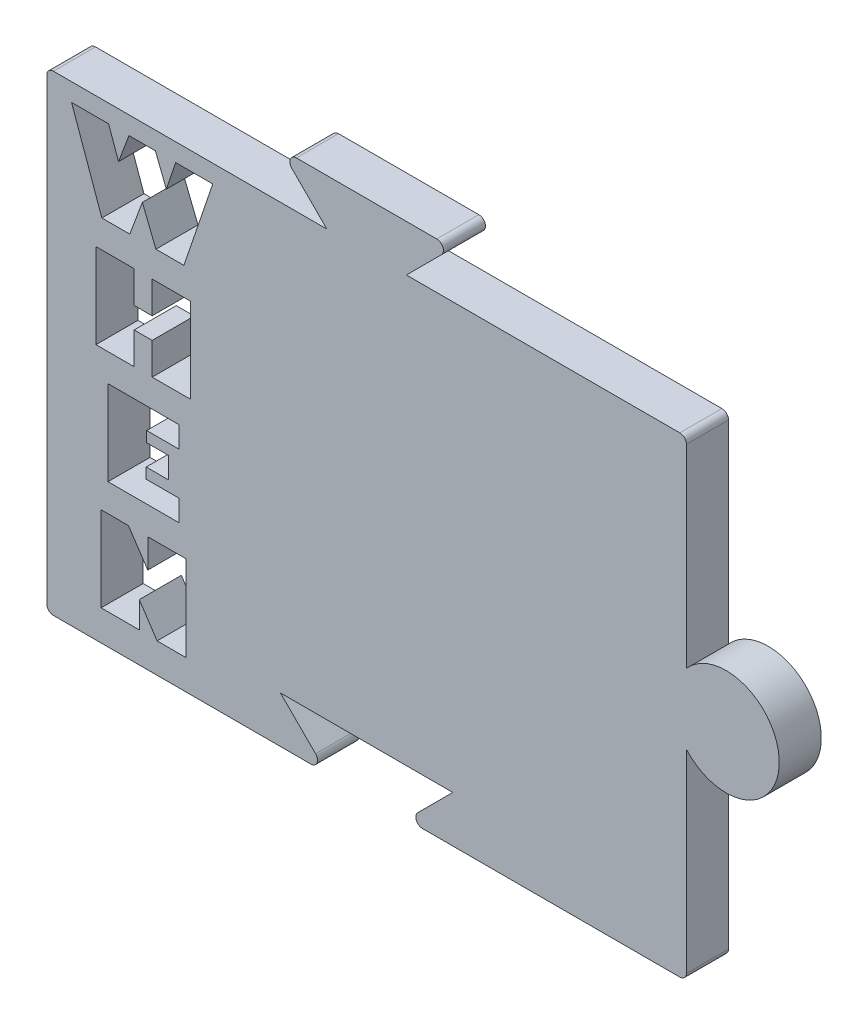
ISO-10303-21;
HEADER;
FILE_DESCRIPTION(('STEP AP214'),'2;1');
FILE_NAME('part.step','',(''),(''),'','','');
FILE_SCHEMA(('AUTOMOTIVE_DESIGN { 1 0 10303 214 1 1 1 1 }'));
ENDSEC;
DATA;
#1=APPLICATION_CONTEXT('core data for automotive mechanical design processes');
#2=APPLICATION_PROTOCOL_DEFINITION('international standard','automotive_design',2000,#1);
#3=PRODUCT_CONTEXT('',#1,'mechanical');
#4=PRODUCT('Part','Part','',(#3));
#5=PRODUCT_RELATED_PRODUCT_CATEGORY('part','',(#4));
#6=PRODUCT_DEFINITION_FORMATION('','',#4);
#7=PRODUCT_DEFINITION_CONTEXT('part definition',#1,'design');
#8=PRODUCT_DEFINITION('design','',#6,#7);
#9=PRODUCT_DEFINITION_SHAPE('','',#8);
#10=(LENGTH_UNIT() NAMED_UNIT(*) SI_UNIT(.MILLI.,.METRE.));
#11=(NAMED_UNIT(*) PLANE_ANGLE_UNIT() SI_UNIT($,.RADIAN.));
#12=(NAMED_UNIT(*) SI_UNIT($,.STERADIAN.) SOLID_ANGLE_UNIT());
#13=UNCERTAINTY_MEASURE_WITH_UNIT(LENGTH_MEASURE(1.E-05),#10,'distance_accuracy_value','');
#14=(GEOMETRIC_REPRESENTATION_CONTEXT(3) GLOBAL_UNCERTAINTY_ASSIGNED_CONTEXT((#13)) GLOBAL_UNIT_ASSIGNED_CONTEXT((#10,
#11,#12)) REPRESENTATION_CONTEXT('',''));
#15=CARTESIAN_POINT('',(0.,0.,0.));
#16=DIRECTION('',(0.,0.,1.));
#17=DIRECTION('',(1.,0.,0.));
#18=AXIS2_PLACEMENT_3D('',#15,#16,#17);
#19=CARTESIAN_POINT('',(51.26,17.78,3.175));
#20=DIRECTION('',(0.,0.,1.));
#21=DIRECTION('',(1.,0.,0.));
#22=AXIS2_PLACEMENT_3D('',#19,#20,#21);
#23=PLANE('',#22);
#24=DIRECTION('',(0.,-1.,0.));
#25=VECTOR('',#24,1.);
#26=CARTESIAN_POINT('',(7.49911100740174,13.1993406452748,3.175));
#27=LINE('',#26,#25);
#28=CARTESIAN_POINT('',(7.49911100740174,13.1993406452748,3.175));
#29=VERTEX_POINT('',#28);
#30=CARTESIAN_POINT('',(7.49911100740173,12.398355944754,3.175));
#31=VERTEX_POINT('',#30);
#32=EDGE_CURVE('E556',#29,#31,#27,.T.);
#33=ORIENTED_EDGE('',*,*,#32,.T.);
#34=DIRECTION('',(1.,0.,0.));
#35=VECTOR('',#34,1.);
#36=CARTESIAN_POINT('',(7.49911100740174,12.398355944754,3.175));
#37=LINE('',#36,#35);
#38=CARTESIAN_POINT('',(9.98216357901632,12.398355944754,3.175));
#39=VERTEX_POINT('',#38);
#40=EDGE_CURVE('E486',#31,#39,#37,.T.);
#41=ORIENTED_EDGE('',*,*,#40,.T.);
#42=DIRECTION('',(0.,-1.,0.));
#43=VECTOR('',#42,1.);
#44=CARTESIAN_POINT('',(9.98216357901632,12.398355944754,3.175));
#45=LINE('',#44,#43);
#46=CARTESIAN_POINT('',(9.98216357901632,10.7963865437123,3.175));
#47=VERTEX_POINT('',#46);
#48=EDGE_CURVE('E582',#39,#47,#45,.T.);
#49=ORIENTED_EDGE('',*,*,#48,.T.);
#50=DIRECTION('',(-1.,0.,0.));
#51=VECTOR('',#50,1.);
#52=CARTESIAN_POINT('',(9.98216357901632,10.7963865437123,3.175));
#53=LINE('',#52,#51);
#54=CARTESIAN_POINT('',(4.61556608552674,10.7963865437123,3.175));
#55=VERTEX_POINT('',#54);
#56=EDGE_CURVE('E585',#47,#55,#53,.T.);
#57=ORIENTED_EDGE('',*,*,#56,.T.);
#58=DIRECTION('',(0.,1.,0.));
#59=VECTOR('',#58,1.);
#60=CARTESIAN_POINT('',(4.61556608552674,10.7963865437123,3.175));
#61=LINE('',#60,#59);
#62=CARTESIAN_POINT('',(4.61556608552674,17.204264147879,3.175));
#63=VERTEX_POINT('',#62);
#64=EDGE_CURVE('E588',#55,#63,#61,.T.);
#65=ORIENTED_EDGE('',*,*,#64,.T.);
#66=DIRECTION('',(1.,0.,0.));
#67=VECTOR('',#66,1.);
#68=CARTESIAN_POINT('',(4.61556608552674,17.204264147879,3.175));
#69=LINE('',#68,#67);
#70=CARTESIAN_POINT('',(9.98216357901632,17.204264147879,3.175));
#71=VERTEX_POINT('',#70);
#72=EDGE_CURVE('E591',#63,#71,#69,.T.);
#73=ORIENTED_EDGE('',*,*,#72,.T.);
#74=DIRECTION('',(0.,-1.,0.));
#75=VECTOR('',#74,1.);
#76=CARTESIAN_POINT('',(9.98216357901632,17.204264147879,3.175));
#77=LINE('',#76,#75);
#78=CARTESIAN_POINT('',(9.98216357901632,15.6022947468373,3.175));
#79=VERTEX_POINT('',#78);
#80=EDGE_CURVE('E594',#71,#79,#77,.T.);
#81=ORIENTED_EDGE('',*,*,#80,.T.);
#82=DIRECTION('',(-1.,0.,0.));
#83=VECTOR('',#82,1.);
#84=CARTESIAN_POINT('',(9.98216357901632,15.6022947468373,3.175));
#85=LINE('',#84,#83);
#86=CARTESIAN_POINT('',(7.53916024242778,15.6022947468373,3.175));
#87=VERTEX_POINT('',#86);
#88=EDGE_CURVE('E597',#79,#87,#85,.T.);
#89=ORIENTED_EDGE('',*,*,#88,.T.);
#90=DIRECTION('',(0.,-1.,0.));
#91=VECTOR('',#90,1.);
#92=CARTESIAN_POINT('',(7.53916024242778,15.6022947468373,3.175));
#93=LINE('',#92,#91);
#94=CARTESIAN_POINT('',(7.53916024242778,14.8013100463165,3.175));
#95=VERTEX_POINT('',#94);
#96=EDGE_CURVE('E600',#87,#95,#93,.T.);
#97=ORIENTED_EDGE('',*,*,#96,.T.);
#98=DIRECTION('',(1.,0.,0.));
#99=VECTOR('',#98,1.);
#100=CARTESIAN_POINT('',(7.53916024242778,14.8013100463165,3.175));
#101=LINE('',#100,#99);
#102=CARTESIAN_POINT('',(9.18117887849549,14.8013100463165,3.175));
#103=VERTEX_POINT('',#102);
#104=EDGE_CURVE('E603',#95,#103,#101,.T.);
#105=ORIENTED_EDGE('',*,*,#104,.T.);
#106=DIRECTION('',(0.,-1.,0.));
#107=VECTOR('',#106,1.);
#108=CARTESIAN_POINT('',(9.18117887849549,14.8013100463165,3.175));
#109=LINE('',#108,#107);
#110=CARTESIAN_POINT('',(9.18117887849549,13.1993406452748,3.175));
#111=VERTEX_POINT('',#110);
#112=EDGE_CURVE('E606',#103,#111,#109,.T.);
#113=ORIENTED_EDGE('',*,*,#112,.T.);
#114=DIRECTION('',(-1.,0.,0.));
#115=VECTOR('',#114,1.);
#116=CARTESIAN_POINT('',(9.18117887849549,13.1993406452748,3.175));
#117=LINE('',#116,#115);
#118=EDGE_CURVE('E609',#111,#29,#117,.T.);
#119=ORIENTED_EDGE('',*,*,#118,.T.);
#120=EDGE_LOOP('',(#33,#41,#49,#57,#65,#73,#81,#89,#97,#105,#113,#119));
#121=FACE_BOUND('',#120,.T.);
#122=DIRECTION('',(-0.371547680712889,0.928413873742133,0.));
#123=VECTOR('',#122,1.);
#124=CARTESIAN_POINT('',(8.23269585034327,27.7963865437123,3.175));
#125=LINE('',#124,#123);
#126=CARTESIAN_POINT('',(8.23269585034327,27.7963865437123,3.175));
#127=VERTEX_POINT('',#126);
#128=CARTESIAN_POINT('',(7.21144035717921,30.3482737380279,3.175));
#129=VERTEX_POINT('',#128);
#130=EDGE_CURVE('E730',#127,#129,#125,.T.);
#131=ORIENTED_EDGE('',*,*,#130,.T.);
#132=DIRECTION('',(-0.348855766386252,-0.937176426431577,0.));
#133=VECTOR('',#132,1.);
#134=CARTESIAN_POINT('',(7.21144035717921,30.3482737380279,3.175));
#135=LINE('',#134,#133);
#136=CARTESIAN_POINT('',(6.26152256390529,27.7963865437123,3.175));
#137=VERTEX_POINT('',#136);
#138=EDGE_CURVE('E726',#129,#137,#135,.T.);
#139=ORIENTED_EDGE('',*,*,#138,.T.);
#140=DIRECTION('',(-1.,0.,0.));
#141=VECTOR('',#140,1.);
#142=CARTESIAN_POINT('',(6.26152256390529,27.7963865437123,3.175));
#143=LINE('',#142,#141);
#144=CARTESIAN_POINT('',(4.15518310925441,27.7963865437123,3.175));
#145=VERTEX_POINT('',#144);
#146=EDGE_CURVE('E758',#137,#145,#143,.T.);
#147=ORIENTED_EDGE('',*,*,#146,.T.);
#148=DIRECTION('',(-0.335916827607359,0.941891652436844,0.));
#149=VECTOR('',#148,1.);
#150=CARTESIAN_POINT('',(4.15518310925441,27.7963865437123,3.175));
#151=LINE('',#150,#149);
#152=CARTESIAN_POINT('',(1.8698736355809,34.204264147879,3.175));
#153=VERTEX_POINT('',#152);
#154=EDGE_CURVE('E761',#145,#153,#151,.T.);
#155=ORIENTED_EDGE('',*,*,#154,.T.);
#156=DIRECTION('',(1.,0.,0.));
#157=VECTOR('',#156,1.);
#158=CARTESIAN_POINT('',(1.8698736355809,34.204264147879,3.175));
#159=LINE('',#158,#157);
#160=CARTESIAN_POINT('',(4.66330777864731,34.204264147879,3.175));
#161=VERTEX_POINT('',#160);
#162=EDGE_CURVE('E764',#153,#161,#159,.T.);
#163=ORIENTED_EDGE('',*,*,#162,.T.);
#164=DIRECTION('',(0.337941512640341,-0.941167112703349,0.));
#165=VECTOR('',#164,1.);
#166=CARTESIAN_POINT('',(4.66330777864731,34.204264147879,3.175));
#167=LINE('',#166,#165);
#168=CARTESIAN_POINT('',(5.41423093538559,32.1129431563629,3.175));
#169=VERTEX_POINT('',#168);
#170=EDGE_CURVE('E767',#161,#169,#167,.T.);
#171=ORIENTED_EDGE('',*,*,#170,.T.);
#172=DIRECTION('',(0.352779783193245,0.935706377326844,0.));
#173=VECTOR('',#172,1.);
#174=CARTESIAN_POINT('',(5.41423093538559,32.1129431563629,3.175));
#175=LINE('',#174,#173);
#176=CARTESIAN_POINT('',(6.20270024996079,34.204264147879,3.175));
#177=VERTEX_POINT('',#176);
#178=EDGE_CURVE('E770',#169,#177,#175,.T.);
#179=ORIENTED_EDGE('',*,*,#178,.T.);
#180=DIRECTION('',(1.,0.,0.));
#181=VECTOR('',#180,1.);
#182=CARTESIAN_POINT('',(6.20270024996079,34.204264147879,3.175));
#183=LINE('',#182,#181);
#184=CARTESIAN_POINT('',(8.1901435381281,34.204264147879,3.175));
#185=VERTEX_POINT('',#184);
#186=EDGE_CURVE('E773',#177,#185,#183,.T.);
#187=ORIENTED_EDGE('',*,*,#186,.T.);
#188=DIRECTION('',(0.36783795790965,-0.92988990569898,0.));
#189=VECTOR('',#188,1.);
#190=CARTESIAN_POINT('',(8.1901435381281,34.204264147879,3.175));
#191=LINE('',#190,#189);
#192=CARTESIAN_POINT('',(9.01741054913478,32.1129431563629,3.175));
#193=VERTEX_POINT('',#192);
#194=EDGE_CURVE('E776',#185,#193,#191,.T.);
#195=ORIENTED_EDGE('',*,*,#194,.T.);
#196=DIRECTION('',(0.320306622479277,0.947313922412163,0.));
#197=VECTOR('',#196,1.);
#198=CARTESIAN_POINT('',(9.01741054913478,32.1129431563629,3.175));
#199=LINE('',#198,#197);
#200=CARTESIAN_POINT('',(9.72452985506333,34.204264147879,3.175));
#201=VERTEX_POINT('',#200);
#202=EDGE_CURVE('E779',#193,#201,#199,.T.);
#203=ORIENTED_EDGE('',*,*,#202,.T.);
#204=DIRECTION('',(1.,0.,0.));
#205=VECTOR('',#204,1.);
#206=CARTESIAN_POINT('',(9.72452985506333,34.204264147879,3.175));
#207=LINE('',#206,#205);
#208=CARTESIAN_POINT('',(12.522970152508,34.204264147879,3.175));
#209=VERTEX_POINT('',#208);
#210=EDGE_CURVE('E782',#201,#209,#207,.T.);
#211=ORIENTED_EDGE('',*,*,#210,.T.);
#212=DIRECTION('',(-0.321935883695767,-0.946761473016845,0.));
#213=VECTOR('',#212,1.);
#214=CARTESIAN_POINT('',(12.522970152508,34.204264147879,3.175));
#215=LINE('',#214,#213);
#216=CARTESIAN_POINT('',(10.3440414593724,27.7963865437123,3.175));
#217=VERTEX_POINT('',#216);
#218=EDGE_CURVE('E785',#209,#217,#215,.T.);
#219=ORIENTED_EDGE('',*,*,#218,.T.);
#220=DIRECTION('',(-1.,0.,0.));
#221=VECTOR('',#220,1.);
#222=CARTESIAN_POINT('',(10.3440414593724,27.7963865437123,3.175));
#223=LINE('',#222,#221);
#224=EDGE_CURVE('E788',#217,#127,#223,.T.);
#225=ORIENTED_EDGE('',*,*,#224,.T.);
#226=EDGE_LOOP('',(#131,#139,#147,#155,#163,#171,#179,#187,#195,#203,#211,#219,#225));
#227=FACE_BOUND('',#226,.T.);
#228=DIRECTION('',(0.,-1.,0.));
#229=VECTOR('',#228,1.);
#230=CARTESIAN_POINT('',(0.,35.56,3.175));
#231=LINE('',#230,#229);
#232=CARTESIAN_POINT('',(0.,35.06,3.175));
#233=VERTEX_POINT('',#232);
#234=CARTESIAN_POINT('',(0.,0.5,3.175));
#235=VERTEX_POINT('',#234);
#236=EDGE_CURVE('E821',#233,#235,#231,.T.);
#237=ORIENTED_EDGE('',*,*,#236,.T.);
#238=CARTESIAN_POINT('',(0.5,0.5,3.175));
#239=DIRECTION('',(0.,0.,1.));
#240=DIRECTION('',(1.,0.,0.));
#241=AXIS2_PLACEMENT_3D('',#238,#239,#240);
#242=CIRCLE('',#241,0.5);
#243=CARTESIAN_POINT('',(0.5,0.,3.175));
#244=VERTEX_POINT('',#243);
#245=EDGE_CURVE('E946',#235,#244,#242,.T.);
#246=ORIENTED_EDGE('',*,*,#245,.T.);
#247=DIRECTION('',(1.,0.,0.));
#248=VECTOR('',#247,1.);
#249=CARTESIAN_POINT('',(0.,0.,3.175));
#250=LINE('',#249,#248);
#251=CARTESIAN_POINT('',(19.9228932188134,0.,3.175));
#252=VERTEX_POINT('',#251);
#253=EDGE_CURVE('E824',#244,#252,#250,.T.);
#254=ORIENTED_EDGE('',*,*,#253,.T.);
#255=CARTESIAN_POINT('',(19.9228932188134,0.499999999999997,3.175));
#256=DIRECTION('',(0.,0.,1.));
#257=DIRECTION('',(1.,0.,0.));
#258=AXIS2_PLACEMENT_3D('',#255,#256,#257);
#259=CIRCLE('',#258,0.5);
#260=CARTESIAN_POINT('',(20.2764466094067,0.853553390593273,3.175));
#261=VERTEX_POINT('',#260);
#262=EDGE_CURVE('E939',#252,#261,#259,.T.);
#263=ORIENTED_EDGE('',*,*,#262,.T.);
#264=DIRECTION('',(-0.707106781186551,0.707106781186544,0.));
#265=VECTOR('',#264,1.);
#266=CARTESIAN_POINT('',(17.63,3.5,3.175));
#267=LINE('',#266,#265);
#268=CARTESIAN_POINT('',(17.63,3.5,3.175));
#269=VERTEX_POINT('',#268);
#270=EDGE_CURVE('E828',#261,#269,#267,.T.);
#271=ORIENTED_EDGE('',*,*,#270,.T.);
#272=DIRECTION('',(1.,0.,0.));
#273=VECTOR('',#272,1.);
#274=CARTESIAN_POINT('',(30.63,3.5,3.175));
#275=LINE('',#274,#273);
#276=CARTESIAN_POINT('',(30.63,3.5,3.175));
#277=VERTEX_POINT('',#276);
#278=EDGE_CURVE('E830',#269,#277,#275,.T.);
#279=ORIENTED_EDGE('',*,*,#278,.T.);
#280=DIRECTION('',(-0.707106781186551,-0.707106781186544,0.));
#281=VECTOR('',#280,1.);
#282=CARTESIAN_POINT('',(27.13,0.,3.175));
#283=LINE('',#282,#281);
#284=CARTESIAN_POINT('',(27.9835533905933,0.853553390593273,3.175));
#285=VERTEX_POINT('',#284);
#286=EDGE_CURVE('E832',#277,#285,#283,.T.);
#287=ORIENTED_EDGE('',*,*,#286,.T.);
#288=CARTESIAN_POINT('',(28.3371067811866,0.499999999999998,3.175));
#289=DIRECTION('',(0.,0.,1.));
#290=DIRECTION('',(1.,0.,0.));
#291=AXIS2_PLACEMENT_3D('',#288,#289,#290);
#292=CIRCLE('',#291,0.5);
#293=CARTESIAN_POINT('',(28.3371067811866,0.,3.175));
#294=VERTEX_POINT('',#293);
#295=EDGE_CURVE('E941',#285,#294,#292,.T.);
#296=ORIENTED_EDGE('',*,*,#295,.T.);
#297=DIRECTION('',(1.,0.,0.));
#298=VECTOR('',#297,1.);
#299=CARTESIAN_POINT('',(48.26,0.,3.175));
#300=LINE('',#299,#298);
#301=CARTESIAN_POINT('',(47.76,0.,3.175));
#302=VERTEX_POINT('',#301);
#303=EDGE_CURVE('E835',#294,#302,#300,.T.);
#304=ORIENTED_EDGE('',*,*,#303,.T.);
#305=CARTESIAN_POINT('',(47.76,0.5,3.175));
#306=DIRECTION('',(0.,0.,1.));
#307=DIRECTION('',(1.,0.,0.));
#308=AXIS2_PLACEMENT_3D('',#305,#306,#307);
#309=CIRCLE('',#308,0.5);
#310=CARTESIAN_POINT('',(48.26,0.5,3.175));
#311=VERTEX_POINT('',#310);
#312=EDGE_CURVE('E935',#302,#311,#309,.T.);
#313=ORIENTED_EDGE('',*,*,#312,.T.);
#314=DIRECTION('',(0.,1.,0.));
#315=VECTOR('',#314,1.);
#316=CARTESIAN_POINT('',(48.26,15.1342486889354,3.175));
#317=LINE('',#316,#315);
#318=CARTESIAN_POINT('',(48.26,15.1342486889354,3.175));
#319=VERTEX_POINT('',#318);
#320=EDGE_CURVE('E838',#311,#319,#317,.T.);
#321=ORIENTED_EDGE('',*,*,#320,.T.);
#322=CARTESIAN_POINT('',(51.26,17.78,3.175));
#323=DIRECTION('',(0.,0.,1.));
#324=DIRECTION('',(1.,0.,0.));
#325=AXIS2_PLACEMENT_3D('',#322,#323,#324);
#326=CIRCLE('',#325,4.);
#327=CARTESIAN_POINT('',(48.26,20.4257513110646,3.175));
#328=VERTEX_POINT('',#327);
#329=EDGE_CURVE('E840',#319,#328,#326,.T.);
#330=ORIENTED_EDGE('',*,*,#329,.T.);
#331=DIRECTION('',(0.,1.,0.));
#332=VECTOR('',#331,1.);
#333=CARTESIAN_POINT('',(48.26,35.56,3.175));
#334=LINE('',#333,#332);
#335=CARTESIAN_POINT('',(48.26,35.06,3.175));
#336=VERTEX_POINT('',#335);
#337=EDGE_CURVE('E842',#328,#336,#334,.T.);
#338=ORIENTED_EDGE('',*,*,#337,.T.);
#339=CARTESIAN_POINT('',(47.76,35.06,3.175));
#340=DIRECTION('',(0.,0.,1.));
#341=DIRECTION('',(1.,0.,0.));
#342=AXIS2_PLACEMENT_3D('',#339,#340,#341);
#343=CIRCLE('',#342,0.5);
#344=CARTESIAN_POINT('',(47.76,35.56,3.175));
#345=VERTEX_POINT('',#344);
#346=EDGE_CURVE('E937',#336,#345,#343,.T.);
#347=ORIENTED_EDGE('',*,*,#346,.T.);
#348=DIRECTION('',(-1.,0.,0.));
#349=VECTOR('',#348,1.);
#350=CARTESIAN_POINT('',(48.26,35.56,3.175));
#351=LINE('',#350,#349);
#352=CARTESIAN_POINT('',(27.13,35.56,3.175));
#353=VERTEX_POINT('',#352);
#354=EDGE_CURVE('E845',#345,#353,#351,.T.);
#355=ORIENTED_EDGE('',*,*,#354,.T.);
#356=DIRECTION('',(0.707106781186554,0.707106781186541,0.));
#357=VECTOR('',#356,1.);
#358=CARTESIAN_POINT('',(27.13,35.56,3.175));
#359=LINE('',#358,#357);
#360=CARTESIAN_POINT('',(29.7764466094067,38.2064466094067,3.175));
#361=VERTEX_POINT('',#360);
#362=EDGE_CURVE('E847',#353,#361,#359,.T.);
#363=ORIENTED_EDGE('',*,*,#362,.T.);
#364=CARTESIAN_POINT('',(29.4228932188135,38.56,3.175));
#365=DIRECTION('',(0.,0.,1.));
#366=DIRECTION('',(1.,0.,0.));
#367=AXIS2_PLACEMENT_3D('',#364,#365,#366);
#368=CIRCLE('',#367,0.5);
#369=CARTESIAN_POINT('',(29.4228932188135,39.06,3.175));
#370=VERTEX_POINT('',#369);
#371=EDGE_CURVE('E944',#361,#370,#368,.T.);
#372=ORIENTED_EDGE('',*,*,#371,.T.);
#373=DIRECTION('',(-1.,0.,0.));
#374=VECTOR('',#373,1.);
#375=CARTESIAN_POINT('',(17.63,39.06,3.175));
#376=LINE('',#375,#374);
#377=CARTESIAN_POINT('',(18.8371067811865,39.06,3.175));
#378=VERTEX_POINT('',#377);
#379=EDGE_CURVE('E850',#370,#378,#376,.T.);
#380=ORIENTED_EDGE('',*,*,#379,.T.);
#381=CARTESIAN_POINT('',(18.8371067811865,38.56,3.175));
#382=DIRECTION('',(0.,0.,1.));
#383=DIRECTION('',(1.,0.,0.));
#384=AXIS2_PLACEMENT_3D('',#381,#382,#383);
#385=CIRCLE('',#384,0.5);
#386=CARTESIAN_POINT('',(18.4835533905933,38.2064466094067,3.175));
#387=VERTEX_POINT('',#386);
#388=EDGE_CURVE('E56',#378,#387,#385,.T.);
#389=ORIENTED_EDGE('',*,*,#388,.T.);
#390=DIRECTION('',(0.707106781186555,-0.70710678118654,0.));
#391=VECTOR('',#390,1.);
#392=CARTESIAN_POINT('',(17.63,39.06,3.175));
#393=LINE('',#392,#391);
#394=CARTESIAN_POINT('',(21.13,35.56,3.175));
#395=VERTEX_POINT('',#394);
#396=EDGE_CURVE('E852',#387,#395,#393,.T.);
#397=ORIENTED_EDGE('',*,*,#396,.T.);
#398=DIRECTION('',(-1.,0.,0.));
#399=VECTOR('',#398,1.);
#400=CARTESIAN_POINT('',(0.,35.56,3.175));
#401=LINE('',#400,#399);
#402=CARTESIAN_POINT('',(0.499999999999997,35.56,3.175));
#403=VERTEX_POINT('',#402);
#404=EDGE_CURVE('E854',#395,#403,#401,.T.);
#405=ORIENTED_EDGE('',*,*,#404,.T.);
#406=CARTESIAN_POINT('',(0.499999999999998,35.06,3.175));
#407=DIRECTION('',(0.,0.,1.));
#408=DIRECTION('',(1.,0.,0.));
#409=AXIS2_PLACEMENT_3D('',#406,#407,#408);
#410=CIRCLE('',#409,0.5);
#411=EDGE_CURVE('E933',#403,#233,#410,.T.);
#412=ORIENTED_EDGE('',*,*,#411,.T.);
#413=EDGE_LOOP('',(#237,#246,#254,#263,#271,#279,#287,#296,#304,#313,#321,#330,#338,#347,#355,
#363,#372,#380,#389,#397,#405,#412));
#414=FACE_BOUND('',#413,.T.);
#415=DIRECTION('',(-1.,0.,0.));
#416=VECTOR('',#415,1.);
#417=CARTESIAN_POINT('',(7.951591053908,21.6993406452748,3.175));
#418=LINE('',#417,#416);
#419=CARTESIAN_POINT('',(7.951591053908,21.6993406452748,3.175));
#420=VERTEX_POINT('',#419);
#421=CARTESIAN_POINT('',(6.58991706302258,21.6993406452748,3.175));
#422=VERTEX_POINT('',#421);
#423=EDGE_CURVE('E643',#420,#422,#418,.T.);
#424=ORIENTED_EDGE('',*,*,#423,.T.);
#425=DIRECTION('',(0.,-1.,0.));
#426=VECTOR('',#425,1.);
#427=CARTESIAN_POINT('',(6.58991706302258,21.6993406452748,3.175));
#428=LINE('',#427,#426);
#429=CARTESIAN_POINT('',(6.58991706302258,19.2963865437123,3.175));
#430=VERTEX_POINT('',#429);
#431=EDGE_CURVE('E639',#422,#430,#428,.T.);
#432=ORIENTED_EDGE('',*,*,#431,.T.);
#433=DIRECTION('',(-1.,0.,0.));
#434=VECTOR('',#433,1.);
#435=CARTESIAN_POINT('',(6.58991706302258,19.2963865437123,3.175));
#436=LINE('',#435,#434);
#437=CARTESIAN_POINT('',(3.70637214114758,19.2963865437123,3.175));
#438=VERTEX_POINT('',#437);
#439=EDGE_CURVE('E669',#430,#438,#436,.T.);
#440=ORIENTED_EDGE('',*,*,#439,.T.);
#441=DIRECTION('',(0.,1.,0.));
#442=VECTOR('',#441,1.);
#443=CARTESIAN_POINT('',(3.70637214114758,19.2963865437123,3.175));
#444=LINE('',#443,#442);
#445=CARTESIAN_POINT('',(3.70637214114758,25.704264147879,3.175));
#446=VERTEX_POINT('',#445);
#447=EDGE_CURVE('E672',#438,#446,#444,.T.);
#448=ORIENTED_EDGE('',*,*,#447,.T.);
#449=DIRECTION('',(1.,0.,0.));
#450=VECTOR('',#449,1.);
#451=CARTESIAN_POINT('',(3.70637214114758,25.704264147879,3.175));
#452=LINE('',#451,#450);
#453=CARTESIAN_POINT('',(6.58991706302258,25.704264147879,3.175));
#454=VERTEX_POINT('',#453);
#455=EDGE_CURVE('E675',#446,#454,#452,.T.);
#456=ORIENTED_EDGE('',*,*,#455,.T.);
#457=DIRECTION('',(0.,-1.,0.));
#458=VECTOR('',#457,1.);
#459=CARTESIAN_POINT('',(6.58991706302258,25.704264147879,3.175));
#460=LINE('',#459,#458);
#461=CARTESIAN_POINT('',(6.58991706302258,23.3013100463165,3.175));
#462=VERTEX_POINT('',#461);
#463=EDGE_CURVE('E678',#454,#462,#460,.T.);
#464=ORIENTED_EDGE('',*,*,#463,.T.);
#465=DIRECTION('',(1.,0.,0.));
#466=VECTOR('',#465,1.);
#467=CARTESIAN_POINT('',(6.58991706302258,23.3013100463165,3.175));
#468=LINE('',#467,#466);
#469=CARTESIAN_POINT('',(7.951591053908,23.3013100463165,3.175));
#470=VERTEX_POINT('',#469);
#471=EDGE_CURVE('E681',#462,#470,#468,.T.);
#472=ORIENTED_EDGE('',*,*,#471,.T.);
#473=DIRECTION('',(0.,1.,0.));
#474=VECTOR('',#473,1.);
#475=CARTESIAN_POINT('',(7.951591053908,23.3013100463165,3.175));
#476=LINE('',#475,#474);
#477=CARTESIAN_POINT('',(7.951591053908,25.704264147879,3.175));
#478=VERTEX_POINT('',#477);
#479=EDGE_CURVE('E684',#470,#478,#476,.T.);
#480=ORIENTED_EDGE('',*,*,#479,.T.);
#481=DIRECTION('',(1.,0.,0.));
#482=VECTOR('',#481,1.);
#483=CARTESIAN_POINT('',(7.951591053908,25.704264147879,3.175));
#484=LINE('',#483,#482);
#485=CARTESIAN_POINT('',(10.835135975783,25.704264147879,3.175));
#486=VERTEX_POINT('',#485);
#487=EDGE_CURVE('E687',#478,#486,#484,.T.);
#488=ORIENTED_EDGE('',*,*,#487,.T.);
#489=DIRECTION('',(0.,-1.,0.));
#490=VECTOR('',#489,1.);
#491=CARTESIAN_POINT('',(10.835135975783,25.704264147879,3.175));
#492=LINE('',#491,#490);
#493=CARTESIAN_POINT('',(10.835135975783,19.2963865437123,3.175));
#494=VERTEX_POINT('',#493);
#495=EDGE_CURVE('E690',#486,#494,#492,.T.);
#496=ORIENTED_EDGE('',*,*,#495,.T.);
#497=DIRECTION('',(-1.,0.,0.));
#498=VECTOR('',#497,1.);
#499=CARTESIAN_POINT('',(10.835135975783,19.2963865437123,3.175));
#500=LINE('',#499,#498);
#501=CARTESIAN_POINT('',(7.951591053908,19.2963865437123,3.175));
#502=VERTEX_POINT('',#501);
#503=EDGE_CURVE('E693',#494,#502,#500,.T.);
#504=ORIENTED_EDGE('',*,*,#503,.T.);
#505=DIRECTION('',(0.,1.,0.));
#506=VECTOR('',#505,1.);
#507=CARTESIAN_POINT('',(7.951591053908,19.2963865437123,3.175));
#508=LINE('',#507,#506);
#509=EDGE_CURVE('E696',#502,#420,#508,.T.);
#510=ORIENTED_EDGE('',*,*,#509,.T.);
#511=EDGE_LOOP('',(#424,#432,#440,#448,#456,#464,#472,#480,#488,#496,#504,#510));
#512=FACE_BOUND('',#511,.T.);
#513=DIRECTION('',(1.,0.,0.));
#514=VECTOR('',#513,1.);
#515=CARTESIAN_POINT('',(7.62064498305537,8.70426414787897,3.175));
#516=LINE('',#515,#514);
#517=CARTESIAN_POINT('',(7.62064498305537,8.70426414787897,3.175));
#518=VERTEX_POINT('',#517);
#519=CARTESIAN_POINT('',(10.5041899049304,8.70426414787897,3.175));
#520=VERTEX_POINT('',#519);
#521=EDGE_CURVE('E479',#518,#520,#516,.T.);
#522=ORIENTED_EDGE('',*,*,#521,.T.);
#523=DIRECTION('',(0.,-1.,0.));
#524=VECTOR('',#523,1.);
#525=CARTESIAN_POINT('',(10.5041899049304,8.70426414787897,3.175));
#526=LINE('',#525,#524);
#527=CARTESIAN_POINT('',(10.5041899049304,2.24632499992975,3.175));
#528=VERTEX_POINT('',#527);
#529=EDGE_CURVE('E511',#520,#528,#526,.T.);
#530=ORIENTED_EDGE('',*,*,#529,.T.);
#531=DIRECTION('',(-1.,0.,0.));
#532=VECTOR('',#531,1.);
#533=CARTESIAN_POINT('',(10.5041899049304,2.24632499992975,3.175));
#534=LINE('',#533,#532);
#535=CARTESIAN_POINT('',(8.32025505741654,2.24632499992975,3.175));
#536=VERTEX_POINT('',#535);
#537=EDGE_CURVE('E485',#528,#536,#534,.T.);
#538=ORIENTED_EDGE('',*,*,#537,.T.);
#539=DIRECTION('',(-0.550777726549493,0.834651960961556,0.));
#540=VECTOR('',#539,1.);
#541=CARTESIAN_POINT('',(8.32025505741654,2.24632499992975,3.175));
#542=LINE('',#541,#540);
#543=CARTESIAN_POINT('',(6.97985722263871,4.2775721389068,3.175));
#544=VERTEX_POINT('',#543);
#545=EDGE_CURVE('E514',#536,#544,#542,.T.);
#546=ORIENTED_EDGE('',*,*,#545,.T.);
#547=DIRECTION('',(0.,-1.,0.));
#548=VECTOR('',#547,1.);
#549=CARTESIAN_POINT('',(6.97985722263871,4.2775721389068,3.175));
#550=LINE('',#549,#548);
#551=CARTESIAN_POINT('',(6.97985722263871,2.29638654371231,3.175));
#552=VERTEX_POINT('',#551);
#553=EDGE_CURVE('E517',#544,#552,#550,.T.);
#554=ORIENTED_EDGE('',*,*,#553,.T.);
#555=DIRECTION('',(-1.,0.,0.));
#556=VECTOR('',#555,1.);
#557=CARTESIAN_POINT('',(6.97985722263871,2.29638654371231,3.175));
#558=LINE('',#557,#556);
#559=CARTESIAN_POINT('',(4.09631230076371,2.29638654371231,3.175));
#560=VERTEX_POINT('',#559);
#561=EDGE_CURVE('E520',#552,#560,#558,.T.);
#562=ORIENTED_EDGE('',*,*,#561,.T.);
#563=DIRECTION('',(0.,1.,0.));
#564=VECTOR('',#563,1.);
#565=CARTESIAN_POINT('',(4.09631230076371,2.29638654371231,3.175));
#566=LINE('',#565,#564);
#567=CARTESIAN_POINT('',(4.09631230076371,8.70426414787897,3.175));
#568=VERTEX_POINT('',#567);
#569=EDGE_CURVE('E523',#560,#568,#566,.T.);
#570=ORIENTED_EDGE('',*,*,#569,.T.);
#571=DIRECTION('',(1.,0.,0.));
#572=VECTOR('',#571,1.);
#573=CARTESIAN_POINT('',(4.09631230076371,8.70426414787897,3.175));
#574=LINE('',#573,#572);
#575=CARTESIAN_POINT('',(6.16009944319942,8.70426414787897,3.175));
#576=VERTEX_POINT('',#575);
#577=EDGE_CURVE('E526',#568,#576,#574,.T.);
#578=ORIENTED_EDGE('',*,*,#577,.T.);
#579=DIRECTION('',(0.556790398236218,-0.830653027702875,0.));
#580=VECTOR('',#579,1.);
#581=CARTESIAN_POINT('',(6.16009944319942,8.70426414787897,3.175));
#582=LINE('',#581,#580);
#583=CARTESIAN_POINT('',(7.62064498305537,6.52533545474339,3.175));
#584=VERTEX_POINT('',#583);
#585=EDGE_CURVE('E529',#576,#584,#582,.T.);
#586=ORIENTED_EDGE('',*,*,#585,.T.);
#587=DIRECTION('',(0.,1.,0.));
#588=VECTOR('',#587,1.);
#589=CARTESIAN_POINT('',(7.62064498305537,6.52533545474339,3.175));
#590=LINE('',#589,#588);
#591=EDGE_CURVE('E532',#584,#518,#590,.T.);
#592=ORIENTED_EDGE('',*,*,#591,.T.);
#593=EDGE_LOOP('',(#522,#530,#538,#546,#554,#562,#570,#578,#586,#592));
#594=FACE_BOUND('',#593,.T.);
#595=ADVANCED_FACE('F35',(#121,#227,#414,#512,#594),#23,.T.);
#596=CARTESIAN_POINT('',(51.26,17.78,0.));
#597=DIRECTION('',(0.,0.,1.));
#598=DIRECTION('',(1.,0.,0.));
#599=AXIS2_PLACEMENT_3D('',#596,#597,#598);
#600=PLANE('',#599);
#601=DIRECTION('',(1.,0.,0.));
#602=VECTOR('',#601,1.);
#603=CARTESIAN_POINT('',(7.49911100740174,12.398355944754,0.));
#604=LINE('',#603,#602);
#605=CARTESIAN_POINT('',(7.49911100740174,12.398355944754,0.));
#606=VERTEX_POINT('',#605);
#607=CARTESIAN_POINT('',(9.98216357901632,12.398355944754,0.));
#608=VERTEX_POINT('',#607);
#609=EDGE_CURVE('E553',#606,#608,#604,.T.);
#610=ORIENTED_EDGE('',*,*,#609,.F.);
#611=DIRECTION('',(0.,-1.,0.));
#612=VECTOR('',#611,1.);
#613=CARTESIAN_POINT('',(7.49911100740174,13.1993406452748,0.));
#614=LINE('',#613,#612);
#615=CARTESIAN_POINT('',(7.49911100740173,13.1993406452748,0.));
#616=VERTEX_POINT('',#615);
#617=EDGE_CURVE('E577',#616,#606,#614,.T.);
#618=ORIENTED_EDGE('',*,*,#617,.F.);
#619=DIRECTION('',(-1.,0.,0.));
#620=VECTOR('',#619,1.);
#621=CARTESIAN_POINT('',(9.18117887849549,13.1993406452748,0.));
#622=LINE('',#621,#620);
#623=CARTESIAN_POINT('',(9.18117887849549,13.1993406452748,0.));
#624=VERTEX_POINT('',#623);
#625=EDGE_CURVE('E574',#624,#616,#622,.T.);
#626=ORIENTED_EDGE('',*,*,#625,.F.);
#627=DIRECTION('',(0.,-1.,0.));
#628=VECTOR('',#627,1.);
#629=CARTESIAN_POINT('',(9.18117887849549,14.8013100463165,0.));
#630=LINE('',#629,#628);
#631=CARTESIAN_POINT('',(9.18117887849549,14.8013100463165,0.));
#632=VERTEX_POINT('',#631);
#633=EDGE_CURVE('E572',#632,#624,#630,.T.);
#634=ORIENTED_EDGE('',*,*,#633,.F.);
#635=DIRECTION('',(1.,0.,0.));
#636=VECTOR('',#635,1.);
#637=CARTESIAN_POINT('',(7.53916024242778,14.8013100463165,0.));
#638=LINE('',#637,#636);
#639=CARTESIAN_POINT('',(7.53916024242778,14.8013100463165,0.));
#640=VERTEX_POINT('',#639);
#641=EDGE_CURVE('E570',#640,#632,#638,.T.);
#642=ORIENTED_EDGE('',*,*,#641,.F.);
#643=DIRECTION('',(0.,-1.,0.));
#644=VECTOR('',#643,1.);
#645=CARTESIAN_POINT('',(7.53916024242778,15.6022947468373,0.));
#646=LINE('',#645,#644);
#647=CARTESIAN_POINT('',(7.53916024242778,15.6022947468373,0.));
#648=VERTEX_POINT('',#647);
#649=EDGE_CURVE('E568',#648,#640,#646,.T.);
#650=ORIENTED_EDGE('',*,*,#649,.F.);
#651=DIRECTION('',(-1.,0.,0.));
#652=VECTOR('',#651,1.);
#653=CARTESIAN_POINT('',(9.98216357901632,15.6022947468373,0.));
#654=LINE('',#653,#652);
#655=CARTESIAN_POINT('',(9.98216357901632,15.6022947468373,0.));
#656=VERTEX_POINT('',#655);
#657=EDGE_CURVE('E566',#656,#648,#654,.T.);
#658=ORIENTED_EDGE('',*,*,#657,.F.);
#659=DIRECTION('',(0.,-1.,0.));
#660=VECTOR('',#659,1.);
#661=CARTESIAN_POINT('',(9.98216357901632,17.204264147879,0.));
#662=LINE('',#661,#660);
#663=CARTESIAN_POINT('',(9.98216357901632,17.204264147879,0.));
#664=VERTEX_POINT('',#663);
#665=EDGE_CURVE('E564',#664,#656,#662,.T.);
#666=ORIENTED_EDGE('',*,*,#665,.F.);
#667=DIRECTION('',(1.,0.,0.));
#668=VECTOR('',#667,1.);
#669=CARTESIAN_POINT('',(4.61556608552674,17.204264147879,0.));
#670=LINE('',#669,#668);
#671=CARTESIAN_POINT('',(4.61556608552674,17.204264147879,0.));
#672=VERTEX_POINT('',#671);
#673=EDGE_CURVE('E562',#672,#664,#670,.T.);
#674=ORIENTED_EDGE('',*,*,#673,.F.);
#675=DIRECTION('',(0.,1.,0.));
#676=VECTOR('',#675,1.);
#677=CARTESIAN_POINT('',(4.61556608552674,10.7963865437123,0.));
#678=LINE('',#677,#676);
#679=CARTESIAN_POINT('',(4.61556608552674,10.7963865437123,0.));
#680=VERTEX_POINT('',#679);
#681=EDGE_CURVE('E560',#680,#672,#678,.T.);
#682=ORIENTED_EDGE('',*,*,#681,.F.);
#683=DIRECTION('',(-1.,0.,0.));
#684=VECTOR('',#683,1.);
#685=CARTESIAN_POINT('',(9.98216357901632,10.7963865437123,0.));
#686=LINE('',#685,#684);
#687=CARTESIAN_POINT('',(9.98216357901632,10.7963865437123,0.));
#688=VERTEX_POINT('',#687);
#689=EDGE_CURVE('E558',#688,#680,#686,.T.);
#690=ORIENTED_EDGE('',*,*,#689,.F.);
#691=DIRECTION('',(0.,-1.,0.));
#692=VECTOR('',#691,1.);
#693=CARTESIAN_POINT('',(9.98216357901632,12.398355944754,0.));
#694=LINE('',#693,#692);
#695=EDGE_CURVE('E555',#608,#688,#694,.T.);
#696=ORIENTED_EDGE('',*,*,#695,.F.);
#697=EDGE_LOOP('',(#610,#618,#626,#634,#642,#650,#658,#666,#674,#682,#690,#696));
#698=FACE_BOUND('',#697,.T.);
#699=DIRECTION('',(-0.348855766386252,-0.937176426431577,0.));
#700=VECTOR('',#699,1.);
#701=CARTESIAN_POINT('',(7.21144035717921,30.3482737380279,0.));
#702=LINE('',#701,#700);
#703=CARTESIAN_POINT('',(7.21144035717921,30.3482737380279,0.));
#704=VERTEX_POINT('',#703);
#705=CARTESIAN_POINT('',(6.26152256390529,27.7963865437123,0.));
#706=VERTEX_POINT('',#705);
#707=EDGE_CURVE('E727',#704,#706,#702,.T.);
#708=ORIENTED_EDGE('',*,*,#707,.F.);
#709=DIRECTION('',(-0.371547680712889,0.928413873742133,0.));
#710=VECTOR('',#709,1.);
#711=CARTESIAN_POINT('',(8.23269585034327,27.7963865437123,0.));
#712=LINE('',#711,#710);
#713=CARTESIAN_POINT('',(8.23269585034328,27.7963865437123,0.));
#714=VERTEX_POINT('',#713);
#715=EDGE_CURVE('E753',#714,#704,#712,.T.);
#716=ORIENTED_EDGE('',*,*,#715,.F.);
#717=DIRECTION('',(-1.,0.,0.));
#718=VECTOR('',#717,1.);
#719=CARTESIAN_POINT('',(10.3440414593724,27.7963865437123,0.));
#720=LINE('',#719,#718);
#721=CARTESIAN_POINT('',(10.3440414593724,27.7963865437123,0.));
#722=VERTEX_POINT('',#721);
#723=EDGE_CURVE('E750',#722,#714,#720,.T.);
#724=ORIENTED_EDGE('',*,*,#723,.F.);
#725=DIRECTION('',(-0.321935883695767,-0.946761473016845,0.));
#726=VECTOR('',#725,1.);
#727=CARTESIAN_POINT('',(12.522970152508,34.204264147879,0.));
#728=LINE('',#727,#726);
#729=CARTESIAN_POINT('',(12.522970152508,34.204264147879,0.));
#730=VERTEX_POINT('',#729);
#731=EDGE_CURVE('E748',#730,#722,#728,.T.);
#732=ORIENTED_EDGE('',*,*,#731,.F.);
#733=DIRECTION('',(1.,0.,0.));
#734=VECTOR('',#733,1.);
#735=CARTESIAN_POINT('',(9.72452985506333,34.204264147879,0.));
#736=LINE('',#735,#734);
#737=CARTESIAN_POINT('',(9.72452985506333,34.204264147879,0.));
#738=VERTEX_POINT('',#737);
#739=EDGE_CURVE('E746',#738,#730,#736,.T.);
#740=ORIENTED_EDGE('',*,*,#739,.F.);
#741=DIRECTION('',(0.320306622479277,0.947313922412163,0.));
#742=VECTOR('',#741,1.);
#743=CARTESIAN_POINT('',(9.01741054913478,32.1129431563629,0.));
#744=LINE('',#743,#742);
#745=CARTESIAN_POINT('',(9.01741054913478,32.1129431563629,0.));
#746=VERTEX_POINT('',#745);
#747=EDGE_CURVE('E744',#746,#738,#744,.T.);
#748=ORIENTED_EDGE('',*,*,#747,.F.);
#749=DIRECTION('',(0.36783795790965,-0.92988990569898,0.));
#750=VECTOR('',#749,1.);
#751=CARTESIAN_POINT('',(8.1901435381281,34.204264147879,0.));
#752=LINE('',#751,#750);
#753=CARTESIAN_POINT('',(8.1901435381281,34.204264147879,0.));
#754=VERTEX_POINT('',#753);
#755=EDGE_CURVE('E742',#754,#746,#752,.T.);
#756=ORIENTED_EDGE('',*,*,#755,.F.);
#757=DIRECTION('',(1.,0.,0.));
#758=VECTOR('',#757,1.);
#759=CARTESIAN_POINT('',(6.20270024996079,34.204264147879,0.));
#760=LINE('',#759,#758);
#761=CARTESIAN_POINT('',(6.20270024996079,34.204264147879,0.));
#762=VERTEX_POINT('',#761);
#763=EDGE_CURVE('E740',#762,#754,#760,.T.);
#764=ORIENTED_EDGE('',*,*,#763,.F.);
#765=DIRECTION('',(0.352779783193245,0.935706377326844,0.));
#766=VECTOR('',#765,1.);
#767=CARTESIAN_POINT('',(5.41423093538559,32.1129431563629,0.));
#768=LINE('',#767,#766);
#769=CARTESIAN_POINT('',(5.41423093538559,32.1129431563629,0.));
#770=VERTEX_POINT('',#769);
#771=EDGE_CURVE('E738',#770,#762,#768,.T.);
#772=ORIENTED_EDGE('',*,*,#771,.F.);
#773=DIRECTION('',(0.337941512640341,-0.941167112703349,0.));
#774=VECTOR('',#773,1.);
#775=CARTESIAN_POINT('',(4.66330777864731,34.204264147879,0.));
#776=LINE('',#775,#774);
#777=CARTESIAN_POINT('',(4.66330777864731,34.204264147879,0.));
#778=VERTEX_POINT('',#777);
#779=EDGE_CURVE('E736',#778,#770,#776,.T.);
#780=ORIENTED_EDGE('',*,*,#779,.F.);
#781=DIRECTION('',(1.,0.,0.));
#782=VECTOR('',#781,1.);
#783=CARTESIAN_POINT('',(1.8698736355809,34.204264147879,0.));
#784=LINE('',#783,#782);
#785=CARTESIAN_POINT('',(1.8698736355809,34.204264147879,0.));
#786=VERTEX_POINT('',#785);
#787=EDGE_CURVE('E734',#786,#778,#784,.T.);
#788=ORIENTED_EDGE('',*,*,#787,.F.);
#789=DIRECTION('',(-0.335916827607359,0.941891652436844,0.));
#790=VECTOR('',#789,1.);
#791=CARTESIAN_POINT('',(4.15518310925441,27.7963865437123,0.));
#792=LINE('',#791,#790);
#793=CARTESIAN_POINT('',(4.15518310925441,27.7963865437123,0.));
#794=VERTEX_POINT('',#793);
#795=EDGE_CURVE('E732',#794,#786,#792,.T.);
#796=ORIENTED_EDGE('',*,*,#795,.F.);
#797=DIRECTION('',(-1.,0.,0.));
#798=VECTOR('',#797,1.);
#799=CARTESIAN_POINT('',(6.26152256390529,27.7963865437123,0.));
#800=LINE('',#799,#798);
#801=EDGE_CURVE('E729',#706,#794,#800,.T.);
#802=ORIENTED_EDGE('',*,*,#801,.F.);
#803=EDGE_LOOP('',(#708,#716,#724,#732,#740,#748,#756,#764,#772,#780,#788,#796,#802));
#804=FACE_BOUND('',#803,.T.);
#805=DIRECTION('',(1.,0.,0.));
#806=VECTOR('',#805,1.);
#807=CARTESIAN_POINT('',(0.,0.,0.));
#808=LINE('',#807,#806);
#809=CARTESIAN_POINT('',(0.5,0.,0.));
#810=VERTEX_POINT('',#809);
#811=CARTESIAN_POINT('',(19.9228932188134,0.,0.));
#812=VERTEX_POINT('',#811);
#813=EDGE_CURVE('E859',#810,#812,#808,.T.);
#814=ORIENTED_EDGE('',*,*,#813,.F.);
#815=CARTESIAN_POINT('',(0.5,0.5,0.));
#816=DIRECTION('',(0.,0.,1.));
#817=DIRECTION('',(1.,0.,0.));
#818=AXIS2_PLACEMENT_3D('',#815,#816,#817);
#819=CIRCLE('',#818,0.5);
#820=CARTESIAN_POINT('',(0.,0.5,0.));
#821=VERTEX_POINT('',#820);
#822=EDGE_CURVE('E926',#810,#821,#819,.F.);
#823=ORIENTED_EDGE('',*,*,#822,.T.);
#824=DIRECTION('',(0.,-1.,0.));
#825=VECTOR('',#824,1.);
#826=CARTESIAN_POINT('',(0.,35.56,0.));
#827=LINE('',#826,#825);
#828=CARTESIAN_POINT('',(0.,35.06,0.));
#829=VERTEX_POINT('',#828);
#830=EDGE_CURVE('E820',#829,#821,#827,.T.);
#831=ORIENTED_EDGE('',*,*,#830,.F.);
#832=CARTESIAN_POINT('',(0.499999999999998,35.06,0.));
#833=DIRECTION('',(0.,0.,1.));
#834=DIRECTION('',(1.,0.,0.));
#835=AXIS2_PLACEMENT_3D('',#832,#833,#834);
#836=CIRCLE('',#835,0.5);
#837=CARTESIAN_POINT('',(0.499999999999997,35.56,0.));
#838=VERTEX_POINT('',#837);
#839=EDGE_CURVE('E912',#829,#838,#836,.F.);
#840=ORIENTED_EDGE('',*,*,#839,.T.);
#841=DIRECTION('',(-1.,0.,0.));
#842=VECTOR('',#841,1.);
#843=CARTESIAN_POINT('',(0.,35.56,0.));
#844=LINE('',#843,#842);
#845=CARTESIAN_POINT('',(21.13,35.56,0.));
#846=VERTEX_POINT('',#845);
#847=EDGE_CURVE('E825',#846,#838,#844,.T.);
#848=ORIENTED_EDGE('',*,*,#847,.F.);
#849=DIRECTION('',(0.707106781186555,-0.70710678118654,0.));
#850=VECTOR('',#849,1.);
#851=CARTESIAN_POINT('',(17.63,39.06,0.));
#852=LINE('',#851,#850);
#853=CARTESIAN_POINT('',(18.4835533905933,38.2064466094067,0.));
#854=VERTEX_POINT('',#853);
#855=EDGE_CURVE('E887',#854,#846,#852,.T.);
#856=ORIENTED_EDGE('',*,*,#855,.F.);
#857=CARTESIAN_POINT('',(18.8371067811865,38.56,0.));
#858=DIRECTION('',(0.,0.,1.));
#859=DIRECTION('',(1.,0.,0.));
#860=AXIS2_PLACEMENT_3D('',#857,#858,#859);
#861=CIRCLE('',#860,0.5);
#862=CARTESIAN_POINT('',(18.8371067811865,39.06,0.));
#863=VERTEX_POINT('',#862);
#864=EDGE_CURVE('E922',#854,#863,#861,.F.);
#865=ORIENTED_EDGE('',*,*,#864,.T.);
#866=DIRECTION('',(-1.,0.,0.));
#867=VECTOR('',#866,1.);
#868=CARTESIAN_POINT('',(17.63,39.06,0.));
#869=LINE('',#868,#867);
#870=CARTESIAN_POINT('',(29.4228932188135,39.06,0.));
#871=VERTEX_POINT('',#870);
#872=EDGE_CURVE('E884',#871,#863,#869,.T.);
#873=ORIENTED_EDGE('',*,*,#872,.F.);
#874=CARTESIAN_POINT('',(29.4228932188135,38.56,0.));
#875=DIRECTION('',(0.,0.,1.));
#876=DIRECTION('',(1.,0.,0.));
#877=AXIS2_PLACEMENT_3D('',#874,#875,#876);
#878=CIRCLE('',#877,0.5);
#879=CARTESIAN_POINT('',(29.7764466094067,38.2064466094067,0.));
#880=VERTEX_POINT('',#879);
#881=EDGE_CURVE('E924',#871,#880,#878,.F.);
#882=ORIENTED_EDGE('',*,*,#881,.T.);
#883=DIRECTION('',(0.707106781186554,0.707106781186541,0.));
#884=VECTOR('',#883,1.);
#885=CARTESIAN_POINT('',(27.13,35.56,0.));
#886=LINE('',#885,#884);
#887=CARTESIAN_POINT('',(27.13,35.56,0.));
#888=VERTEX_POINT('',#887);
#889=EDGE_CURVE('E881',#888,#880,#886,.T.);
#890=ORIENTED_EDGE('',*,*,#889,.F.);
#891=DIRECTION('',(-1.,0.,0.));
#892=VECTOR('',#891,1.);
#893=CARTESIAN_POINT('',(48.26,35.56,0.));
#894=LINE('',#893,#892);
#895=CARTESIAN_POINT('',(47.76,35.56,0.));
#896=VERTEX_POINT('',#895);
#897=EDGE_CURVE('E879',#896,#888,#894,.T.);
#898=ORIENTED_EDGE('',*,*,#897,.F.);
#899=CARTESIAN_POINT('',(47.76,35.06,0.));
#900=DIRECTION('',(0.,0.,1.));
#901=DIRECTION('',(1.,0.,0.));
#902=AXIS2_PLACEMENT_3D('',#899,#900,#901);
#903=CIRCLE('',#902,0.5);
#904=CARTESIAN_POINT('',(48.26,35.06,0.));
#905=VERTEX_POINT('',#904);
#906=EDGE_CURVE('E916',#896,#905,#903,.F.);
#907=ORIENTED_EDGE('',*,*,#906,.T.);
#908=DIRECTION('',(0.,1.,0.));
#909=VECTOR('',#908,1.);
#910=CARTESIAN_POINT('',(48.26,35.56,0.));
#911=LINE('',#910,#909);
#912=CARTESIAN_POINT('',(48.26,20.4257513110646,0.));
#913=VERTEX_POINT('',#912);
#914=EDGE_CURVE('E876',#913,#905,#911,.T.);
#915=ORIENTED_EDGE('',*,*,#914,.F.);
#916=CARTESIAN_POINT('',(51.26,17.78,0.));
#917=DIRECTION('',(0.,0.,1.));
#918=DIRECTION('',(1.,0.,0.));
#919=AXIS2_PLACEMENT_3D('',#916,#917,#918);
#920=CIRCLE('',#919,4.);
#921=CARTESIAN_POINT('',(48.26,15.1342486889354,0.));
#922=VERTEX_POINT('',#921);
#923=EDGE_CURVE('E874',#922,#913,#920,.T.);
#924=ORIENTED_EDGE('',*,*,#923,.F.);
#925=DIRECTION('',(0.,1.,0.));
#926=VECTOR('',#925,1.);
#927=CARTESIAN_POINT('',(48.26,15.1342486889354,0.));
#928=LINE('',#927,#926);
#929=CARTESIAN_POINT('',(48.26,0.5,0.));
#930=VERTEX_POINT('',#929);
#931=EDGE_CURVE('E872',#930,#922,#928,.T.);
#932=ORIENTED_EDGE('',*,*,#931,.F.);
#933=CARTESIAN_POINT('',(47.76,0.5,0.));
#934=DIRECTION('',(0.,0.,1.));
#935=DIRECTION('',(1.,0.,0.));
#936=AXIS2_PLACEMENT_3D('',#933,#934,#935);
#937=CIRCLE('',#936,0.5);
#938=CARTESIAN_POINT('',(47.76,0.,0.));
#939=VERTEX_POINT('',#938);
#940=EDGE_CURVE('E914',#930,#939,#937,.F.);
#941=ORIENTED_EDGE('',*,*,#940,.T.);
#942=DIRECTION('',(1.,0.,0.));
#943=VECTOR('',#942,1.);
#944=CARTESIAN_POINT('',(48.26,0.,0.));
#945=LINE('',#944,#943);
#946=CARTESIAN_POINT('',(28.3371067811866,0.,0.));
#947=VERTEX_POINT('',#946);
#948=EDGE_CURVE('E869',#947,#939,#945,.T.);
#949=ORIENTED_EDGE('',*,*,#948,.F.);
#950=CARTESIAN_POINT('',(28.3371067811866,0.499999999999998,0.));
#951=DIRECTION('',(0.,0.,1.));
#952=DIRECTION('',(1.,0.,0.));
#953=AXIS2_PLACEMENT_3D('',#950,#951,#952);
#954=CIRCLE('',#953,0.5);
#955=CARTESIAN_POINT('',(27.9835533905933,0.853553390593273,0.));
#956=VERTEX_POINT('',#955);
#957=EDGE_CURVE('E920',#947,#956,#954,.F.);
#958=ORIENTED_EDGE('',*,*,#957,.T.);
#959=DIRECTION('',(-0.707106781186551,-0.707106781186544,0.));
#960=VECTOR('',#959,1.);
#961=CARTESIAN_POINT('',(27.13,0.,0.));
#962=LINE('',#961,#960);
#963=CARTESIAN_POINT('',(30.63,3.5,0.));
#964=VERTEX_POINT('',#963);
#965=EDGE_CURVE('E866',#964,#956,#962,.T.);
#966=ORIENTED_EDGE('',*,*,#965,.F.);
#967=DIRECTION('',(1.,0.,0.));
#968=VECTOR('',#967,1.);
#969=CARTESIAN_POINT('',(30.63,3.5,0.));
#970=LINE('',#969,#968);
#971=CARTESIAN_POINT('',(17.63,3.5,0.));
#972=VERTEX_POINT('',#971);
#973=EDGE_CURVE('E864',#972,#964,#970,.T.);
#974=ORIENTED_EDGE('',*,*,#973,.F.);
#975=DIRECTION('',(-0.707106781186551,0.707106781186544,0.));
#976=VECTOR('',#975,1.);
#977=CARTESIAN_POINT('',(17.63,3.5,0.));
#978=LINE('',#977,#976);
#979=CARTESIAN_POINT('',(20.2764466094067,0.853553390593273,0.));
#980=VERTEX_POINT('',#979);
#981=EDGE_CURVE('E862',#980,#972,#978,.T.);
#982=ORIENTED_EDGE('',*,*,#981,.F.);
#983=CARTESIAN_POINT('',(19.9228932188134,0.499999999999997,0.));
#984=DIRECTION('',(0.,0.,1.));
#985=DIRECTION('',(1.,0.,0.));
#986=AXIS2_PLACEMENT_3D('',#983,#984,#985);
#987=CIRCLE('',#986,0.5);
#988=EDGE_CURVE('E918',#980,#812,#987,.F.);
#989=ORIENTED_EDGE('',*,*,#988,.T.);
#990=EDGE_LOOP('',(#814,#823,#831,#840,#848,#856,#865,#873,#882,#890,#898,#907,#915,#924,#932,
#941,#949,#958,#966,#974,#982,#989));
#991=FACE_BOUND('',#990,.T.);
#992=DIRECTION('',(0.,-1.,0.));
#993=VECTOR('',#992,1.);
#994=CARTESIAN_POINT('',(6.58991706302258,21.6993406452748,0.));
#995=LINE('',#994,#993);
#996=CARTESIAN_POINT('',(6.58991706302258,21.6993406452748,0.));
#997=VERTEX_POINT('',#996);
#998=CARTESIAN_POINT('',(6.58991706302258,19.2963865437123,0.));
#999=VERTEX_POINT('',#998);
#1000=EDGE_CURVE('E640',#997,#999,#995,.T.);
#1001=ORIENTED_EDGE('',*,*,#1000,.F.);
#1002=DIRECTION('',(-1.,0.,0.));
#1003=VECTOR('',#1002,1.);
#1004=CARTESIAN_POINT('',(7.951591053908,21.6993406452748,0.));
#1005=LINE('',#1004,#1003);
#1006=CARTESIAN_POINT('',(7.951591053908,21.6993406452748,0.));
#1007=VERTEX_POINT('',#1006);
#1008=EDGE_CURVE('E664',#1007,#997,#1005,.T.);
#1009=ORIENTED_EDGE('',*,*,#1008,.F.);
#1010=DIRECTION('',(0.,1.,0.));
#1011=VECTOR('',#1010,1.);
#1012=CARTESIAN_POINT('',(7.951591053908,19.2963865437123,0.));
#1013=LINE('',#1012,#1011);
#1014=CARTESIAN_POINT('',(7.951591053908,19.2963865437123,0.));
#1015=VERTEX_POINT('',#1014);
#1016=EDGE_CURVE('E661',#1015,#1007,#1013,.T.);
#1017=ORIENTED_EDGE('',*,*,#1016,.F.);
#1018=DIRECTION('',(-1.,0.,0.));
#1019=VECTOR('',#1018,1.);
#1020=CARTESIAN_POINT('',(10.835135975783,19.2963865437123,0.));
#1021=LINE('',#1020,#1019);
#1022=CARTESIAN_POINT('',(10.835135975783,19.2963865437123,0.));
#1023=VERTEX_POINT('',#1022);
#1024=EDGE_CURVE('E659',#1023,#1015,#1021,.T.);
#1025=ORIENTED_EDGE('',*,*,#1024,.F.);
#1026=DIRECTION('',(0.,-1.,0.));
#1027=VECTOR('',#1026,1.);
#1028=CARTESIAN_POINT('',(10.835135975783,25.704264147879,0.));
#1029=LINE('',#1028,#1027);
#1030=CARTESIAN_POINT('',(10.835135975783,25.704264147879,0.));
#1031=VERTEX_POINT('',#1030);
#1032=EDGE_CURVE('E657',#1031,#1023,#1029,.T.);
#1033=ORIENTED_EDGE('',*,*,#1032,.F.);
#1034=DIRECTION('',(1.,0.,0.));
#1035=VECTOR('',#1034,1.);
#1036=CARTESIAN_POINT('',(7.951591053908,25.704264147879,0.));
#1037=LINE('',#1036,#1035);
#1038=CARTESIAN_POINT('',(7.951591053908,25.704264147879,0.));
#1039=VERTEX_POINT('',#1038);
#1040=EDGE_CURVE('E655',#1039,#1031,#1037,.T.);
#1041=ORIENTED_EDGE('',*,*,#1040,.F.);
#1042=DIRECTION('',(0.,1.,0.));
#1043=VECTOR('',#1042,1.);
#1044=CARTESIAN_POINT('',(7.951591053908,23.3013100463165,0.));
#1045=LINE('',#1044,#1043);
#1046=CARTESIAN_POINT('',(7.951591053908,23.3013100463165,0.));
#1047=VERTEX_POINT('',#1046);
#1048=EDGE_CURVE('E653',#1047,#1039,#1045,.T.);
#1049=ORIENTED_EDGE('',*,*,#1048,.F.);
#1050=DIRECTION('',(1.,0.,0.));
#1051=VECTOR('',#1050,1.);
#1052=CARTESIAN_POINT('',(6.58991706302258,23.3013100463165,0.));
#1053=LINE('',#1052,#1051);
#1054=CARTESIAN_POINT('',(6.58991706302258,23.3013100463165,0.));
#1055=VERTEX_POINT('',#1054);
#1056=EDGE_CURVE('E651',#1055,#1047,#1053,.T.);
#1057=ORIENTED_EDGE('',*,*,#1056,.F.);
#1058=DIRECTION('',(0.,-1.,0.));
#1059=VECTOR('',#1058,1.);
#1060=CARTESIAN_POINT('',(6.58991706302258,25.704264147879,0.));
#1061=LINE('',#1060,#1059);
#1062=CARTESIAN_POINT('',(6.58991706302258,25.704264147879,0.));
#1063=VERTEX_POINT('',#1062);
#1064=EDGE_CURVE('E649',#1063,#1055,#1061,.T.);
#1065=ORIENTED_EDGE('',*,*,#1064,.F.);
#1066=DIRECTION('',(1.,0.,0.));
#1067=VECTOR('',#1066,1.);
#1068=CARTESIAN_POINT('',(3.70637214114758,25.704264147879,0.));
#1069=LINE('',#1068,#1067);
#1070=CARTESIAN_POINT('',(3.70637214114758,25.704264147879,0.));
#1071=VERTEX_POINT('',#1070);
#1072=EDGE_CURVE('E647',#1071,#1063,#1069,.T.);
#1073=ORIENTED_EDGE('',*,*,#1072,.F.);
#1074=DIRECTION('',(0.,1.,0.));
#1075=VECTOR('',#1074,1.);
#1076=CARTESIAN_POINT('',(3.70637214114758,19.2963865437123,0.));
#1077=LINE('',#1076,#1075);
#1078=CARTESIAN_POINT('',(3.70637214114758,19.2963865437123,0.));
#1079=VERTEX_POINT('',#1078);
#1080=EDGE_CURVE('E645',#1079,#1071,#1077,.T.);
#1081=ORIENTED_EDGE('',*,*,#1080,.F.);
#1082=DIRECTION('',(-1.,0.,0.));
#1083=VECTOR('',#1082,1.);
#1084=CARTESIAN_POINT('',(6.58991706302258,19.2963865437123,0.));
#1085=LINE('',#1084,#1083);
#1086=EDGE_CURVE('E642',#999,#1079,#1085,.T.);
#1087=ORIENTED_EDGE('',*,*,#1086,.F.);
#1088=EDGE_LOOP('',(#1001,#1009,#1017,#1025,#1033,#1041,#1049,#1057,#1065,#1073,#1081,#1087));
#1089=FACE_BOUND('',#1088,.T.);
#1090=DIRECTION('',(0.,-1.,0.));
#1091=VECTOR('',#1090,1.);
#1092=CARTESIAN_POINT('',(10.5041899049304,8.70426414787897,0.));
#1093=LINE('',#1092,#1091);
#1094=CARTESIAN_POINT('',(10.5041899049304,8.70426414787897,0.));
#1095=VERTEX_POINT('',#1094);
#1096=CARTESIAN_POINT('',(10.5041899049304,2.24632499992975,0.));
#1097=VERTEX_POINT('',#1096);
#1098=EDGE_CURVE('E468',#1095,#1097,#1093,.T.);
#1099=ORIENTED_EDGE('',*,*,#1098,.F.);
#1100=DIRECTION('',(1.,0.,0.));
#1101=VECTOR('',#1100,1.);
#1102=CARTESIAN_POINT('',(7.62064498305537,8.70426414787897,0.));
#1103=LINE('',#1102,#1101);
#1104=CARTESIAN_POINT('',(7.62064498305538,8.70426414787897,0.));
#1105=VERTEX_POINT('',#1104);
#1106=EDGE_CURVE('E509',#1105,#1095,#1103,.T.);
#1107=ORIENTED_EDGE('',*,*,#1106,.F.);
#1108=DIRECTION('',(0.,1.,0.));
#1109=VECTOR('',#1108,1.);
#1110=CARTESIAN_POINT('',(7.62064498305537,6.52533545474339,0.));
#1111=LINE('',#1110,#1109);
#1112=CARTESIAN_POINT('',(7.62064498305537,6.52533545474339,0.));
#1113=VERTEX_POINT('',#1112);
#1114=EDGE_CURVE('E506',#1113,#1105,#1111,.T.);
#1115=ORIENTED_EDGE('',*,*,#1114,.F.);
#1116=DIRECTION('',(0.556790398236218,-0.830653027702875,0.));
#1117=VECTOR('',#1116,1.);
#1118=CARTESIAN_POINT('',(6.16009944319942,8.70426414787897,0.));
#1119=LINE('',#1118,#1117);
#1120=CARTESIAN_POINT('',(6.16009944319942,8.70426414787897,0.));
#1121=VERTEX_POINT('',#1120);
#1122=EDGE_CURVE('E504',#1121,#1113,#1119,.T.);
#1123=ORIENTED_EDGE('',*,*,#1122,.F.);
#1124=DIRECTION('',(1.,0.,0.));
#1125=VECTOR('',#1124,1.);
#1126=CARTESIAN_POINT('',(4.09631230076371,8.70426414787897,0.));
#1127=LINE('',#1126,#1125);
#1128=CARTESIAN_POINT('',(4.09631230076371,8.70426414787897,0.));
#1129=VERTEX_POINT('',#1128);
#1130=EDGE_CURVE('E502',#1129,#1121,#1127,.T.);
#1131=ORIENTED_EDGE('',*,*,#1130,.F.);
#1132=DIRECTION('',(0.,1.,0.));
#1133=VECTOR('',#1132,1.);
#1134=CARTESIAN_POINT('',(4.09631230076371,2.29638654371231,0.));
#1135=LINE('',#1134,#1133);
#1136=CARTESIAN_POINT('',(4.09631230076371,2.29638654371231,0.));
#1137=VERTEX_POINT('',#1136);
#1138=EDGE_CURVE('E500',#1137,#1129,#1135,.T.);
#1139=ORIENTED_EDGE('',*,*,#1138,.F.);
#1140=DIRECTION('',(-1.,0.,0.));
#1141=VECTOR('',#1140,1.);
#1142=CARTESIAN_POINT('',(6.97985722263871,2.29638654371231,0.));
#1143=LINE('',#1142,#1141);
#1144=CARTESIAN_POINT('',(6.97985722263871,2.29638654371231,0.));
#1145=VERTEX_POINT('',#1144);
#1146=EDGE_CURVE('E498',#1145,#1137,#1143,.T.);
#1147=ORIENTED_EDGE('',*,*,#1146,.F.);
#1148=DIRECTION('',(0.,-1.,0.));
#1149=VECTOR('',#1148,1.);
#1150=CARTESIAN_POINT('',(6.97985722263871,4.2775721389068,0.));
#1151=LINE('',#1150,#1149);
#1152=CARTESIAN_POINT('',(6.97985722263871,4.2775721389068,0.));
#1153=VERTEX_POINT('',#1152);
#1154=EDGE_CURVE('E494',#1153,#1145,#1151,.T.);
#1155=ORIENTED_EDGE('',*,*,#1154,.F.);
#1156=DIRECTION('',(-0.550777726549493,0.834651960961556,0.));
#1157=VECTOR('',#1156,1.);
#1158=CARTESIAN_POINT('',(8.32025505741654,2.24632499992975,0.));
#1159=LINE('',#1158,#1157);
#1160=CARTESIAN_POINT('',(8.32025505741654,2.24632499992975,0.));
#1161=VERTEX_POINT('',#1160);
#1162=EDGE_CURVE('E492',#1161,#1153,#1159,.T.);
#1163=ORIENTED_EDGE('',*,*,#1162,.F.);
#1164=DIRECTION('',(-1.,0.,0.));
#1165=VECTOR('',#1164,1.);
#1166=CARTESIAN_POINT('',(10.5041899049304,2.24632499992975,0.));
#1167=LINE('',#1166,#1165);
#1168=EDGE_CURVE('E478',#1097,#1161,#1167,.T.);
#1169=ORIENTED_EDGE('',*,*,#1168,.F.);
#1170=EDGE_LOOP('',(#1099,#1107,#1115,#1123,#1131,#1139,#1147,#1155,#1163,#1169));
#1171=FACE_BOUND('',#1170,.T.);
#1172=ADVANCED_FACE('F490',(#698,#804,#991,#1089,#1171),#600,.F.);
#1173=CARTESIAN_POINT('',(0.,35.56,3.175));
#1174=DIRECTION('',(1.,0.,0.));
#1175=DIRECTION('',(0.,1.,0.));
#1176=AXIS2_PLACEMENT_3D('',#1173,#1174,#1175);
#1177=PLANE('',#1176);
#1178=ORIENTED_EDGE('',*,*,#830,.T.);
#1179=DIRECTION('',(0.,0.,-1.));
#1180=VECTOR('',#1179,1.);
#1181=CARTESIAN_POINT('',(0.,0.5,3.175));
#1182=LINE('',#1181,#1180);
#1183=EDGE_CURVE('E931',#821,#235,#1182,.F.);
#1184=ORIENTED_EDGE('',*,*,#1183,.T.);
#1185=ORIENTED_EDGE('',*,*,#236,.F.);
#1186=DIRECTION('',(0.,0.,-1.));
#1187=VECTOR('',#1186,1.);
#1188=CARTESIAN_POINT('',(0.,35.06,3.175));
#1189=LINE('',#1188,#1187);
#1190=EDGE_CURVE('E928',#233,#829,#1189,.T.);
#1191=ORIENTED_EDGE('',*,*,#1190,.T.);
#1192=EDGE_LOOP('',(#1178,#1184,#1185,#1191));
#1193=FACE_BOUND('',#1192,.T.);
#1194=ADVANCED_FACE('F1035',(#1193),#1177,.F.);
#1195=CARTESIAN_POINT('',(0.,0.,3.175));
#1196=DIRECTION('',(0.,1.,0.));
#1197=DIRECTION('',(-1.,0.,0.));
#1198=AXIS2_PLACEMENT_3D('',#1195,#1196,#1197);
#1199=PLANE('',#1198);
#1200=ORIENTED_EDGE('',*,*,#253,.F.);
#1201=DIRECTION('',(0.,0.,-1.));
#1202=VECTOR('',#1201,1.);
#1203=CARTESIAN_POINT('',(0.5,0.,3.175));
#1204=LINE('',#1203,#1202);
#1205=EDGE_CURVE('E909',#244,#810,#1204,.T.);
#1206=ORIENTED_EDGE('',*,*,#1205,.T.);
#1207=ORIENTED_EDGE('',*,*,#813,.T.);
#1208=DIRECTION('',(0.,0.,-1.));
#1209=VECTOR('',#1208,1.);
#1210=CARTESIAN_POINT('',(19.9228932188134,0.,3.175));
#1211=LINE('',#1210,#1209);
#1212=EDGE_CURVE('E907',#812,#252,#1211,.F.);
#1213=ORIENTED_EDGE('',*,*,#1212,.T.);
#1214=EDGE_LOOP('',(#1200,#1206,#1207,#1213));
#1215=FACE_BOUND('',#1214,.T.);
#1216=ADVANCED_FACE('F1043',(#1215),#1199,.F.);
#1217=CARTESIAN_POINT('',(17.63,3.5,3.175));
#1218=DIRECTION('',(-0.707106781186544,-0.707106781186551,0.));
#1219=DIRECTION('',(0.707106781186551,-0.707106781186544,0.));
#1220=AXIS2_PLACEMENT_3D('',#1217,#1218,#1219);
#1221=PLANE('',#1220);
#1222=ORIENTED_EDGE('',*,*,#270,.F.);
#1223=DIRECTION('',(0.,0.,-1.));
#1224=VECTOR('',#1223,1.);
#1225=CARTESIAN_POINT('',(20.2764466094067,0.853553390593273,3.175));
#1226=LINE('',#1225,#1224);
#1227=EDGE_CURVE('E965',#261,#980,#1226,.T.);
#1228=ORIENTED_EDGE('',*,*,#1227,.T.);
#1229=ORIENTED_EDGE('',*,*,#981,.T.);
#1230=DIRECTION('',(0.,0.,-1.));
#1231=VECTOR('',#1230,1.);
#1232=CARTESIAN_POINT('',(17.63,3.5,3.175));
#1233=LINE('',#1232,#1231);
#1234=EDGE_CURVE('E904',#269,#972,#1233,.T.);
#1235=ORIENTED_EDGE('',*,*,#1234,.F.);
#1236=EDGE_LOOP('',(#1222,#1228,#1229,#1235));
#1237=FACE_BOUND('',#1236,.T.);
#1238=ADVANCED_FACE('F1051',(#1237),#1221,.F.);
#1239=CARTESIAN_POINT('',(30.63,3.5,3.175));
#1240=DIRECTION('',(0.,1.,0.));
#1241=DIRECTION('',(-1.,0.,0.));
#1242=AXIS2_PLACEMENT_3D('',#1239,#1240,#1241);
#1243=PLANE('',#1242);
#1244=ORIENTED_EDGE('',*,*,#973,.T.);
#1245=DIRECTION('',(0.,0.,-1.));
#1246=VECTOR('',#1245,1.);
#1247=CARTESIAN_POINT('',(30.63,3.5,3.175));
#1248=LINE('',#1247,#1246);
#1249=EDGE_CURVE('E901',#277,#964,#1248,.T.);
#1250=ORIENTED_EDGE('',*,*,#1249,.F.);
#1251=ORIENTED_EDGE('',*,*,#278,.F.);
#1252=ORIENTED_EDGE('',*,*,#1234,.T.);
#1253=EDGE_LOOP('',(#1244,#1250,#1251,#1252));
#1254=FACE_BOUND('',#1253,.T.);
#1255=ADVANCED_FACE('F1057',(#1254),#1243,.F.);
#1256=CARTESIAN_POINT('',(27.13,0.,3.175));
#1257=DIRECTION('',(0.707106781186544,-0.707106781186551,0.));
#1258=DIRECTION('',(0.707106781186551,0.707106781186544,0.));
#1259=AXIS2_PLACEMENT_3D('',#1256,#1257,#1258);
#1260=PLANE('',#1259);
#1261=ORIENTED_EDGE('',*,*,#965,.T.);
#1262=DIRECTION('',(0.,0.,-1.));
#1263=VECTOR('',#1262,1.);
#1264=CARTESIAN_POINT('',(27.9835533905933,0.853553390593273,3.175));
#1265=LINE('',#1264,#1263);
#1266=EDGE_CURVE('E963',#956,#285,#1265,.F.);
#1267=ORIENTED_EDGE('',*,*,#1266,.T.);
#1268=ORIENTED_EDGE('',*,*,#286,.F.);
#1269=ORIENTED_EDGE('',*,*,#1249,.T.);
#1270=EDGE_LOOP('',(#1261,#1267,#1268,#1269));
#1271=FACE_BOUND('',#1270,.T.);
#1272=ADVANCED_FACE('F1070',(#1271),#1260,.F.);
#1273=CARTESIAN_POINT('',(48.26,0.,3.175));
#1274=DIRECTION('',(0.,1.,0.));
#1275=DIRECTION('',(-1.,0.,0.));
#1276=AXIS2_PLACEMENT_3D('',#1273,#1274,#1275);
#1277=PLANE('',#1276);
#1278=ORIENTED_EDGE('',*,*,#303,.F.);
#1279=DIRECTION('',(0.,0.,-1.));
#1280=VECTOR('',#1279,1.);
#1281=CARTESIAN_POINT('',(28.3371067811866,0.,3.175));
#1282=LINE('',#1281,#1280);
#1283=EDGE_CURVE('E960',#294,#947,#1282,.T.);
#1284=ORIENTED_EDGE('',*,*,#1283,.T.);
#1285=ORIENTED_EDGE('',*,*,#948,.T.);
#1286=DIRECTION('',(0.,0.,-1.));
#1287=VECTOR('',#1286,1.);
#1288=CARTESIAN_POINT('',(47.76,0.,3.175));
#1289=LINE('',#1288,#1287);
#1290=EDGE_CURVE('E958',#939,#302,#1289,.F.);
#1291=ORIENTED_EDGE('',*,*,#1290,.T.);
#1292=EDGE_LOOP('',(#1278,#1284,#1285,#1291));
#1293=FACE_BOUND('',#1292,.T.);
#1294=ADVANCED_FACE('F1067',(#1293),#1277,.F.);
#1295=CARTESIAN_POINT('',(48.26,15.1342486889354,3.175));
#1296=DIRECTION('',(-1.,0.,0.));
#1297=DIRECTION('',(0.,-1.,0.));
#1298=AXIS2_PLACEMENT_3D('',#1295,#1296,#1297);
#1299=PLANE('',#1298);
#1300=ORIENTED_EDGE('',*,*,#320,.F.);
#1301=DIRECTION('',(0.,0.,-1.));
#1302=VECTOR('',#1301,1.);
#1303=CARTESIAN_POINT('',(48.26,0.5,3.175));
#1304=LINE('',#1303,#1302);
#1305=EDGE_CURVE('E43',#311,#930,#1304,.T.);
#1306=ORIENTED_EDGE('',*,*,#1305,.T.);
#1307=ORIENTED_EDGE('',*,*,#931,.T.);
#1308=DIRECTION('',(0.,0.,-1.));
#1309=VECTOR('',#1308,1.);
#1310=CARTESIAN_POINT('',(48.26,15.1342486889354,3.175));
#1311=LINE('',#1310,#1309);
#1312=EDGE_CURVE('E898',#319,#922,#1311,.T.);
#1313=ORIENTED_EDGE('',*,*,#1312,.F.);
#1314=EDGE_LOOP('',(#1300,#1306,#1307,#1313));
#1315=FACE_BOUND('',#1314,.T.);
#1316=ADVANCED_FACE('F977',(#1315),#1299,.F.);
#1317=CARTESIAN_POINT('',(51.26,17.78,3.175));
#1318=DIRECTION('',(0.,0.,-1.));
#1319=DIRECTION('',(-1.,0.,0.));
#1320=AXIS2_PLACEMENT_3D('',#1317,#1318,#1319);
#1321=CYLINDRICAL_SURFACE('',#1320,4.);
#1322=ORIENTED_EDGE('',*,*,#923,.T.);
#1323=DIRECTION('',(0.,0.,-1.));
#1324=VECTOR('',#1323,1.);
#1325=CARTESIAN_POINT('',(48.26,20.4257513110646,3.175));
#1326=LINE('',#1325,#1324);
#1327=EDGE_CURVE('E895',#328,#913,#1326,.T.);
#1328=ORIENTED_EDGE('',*,*,#1327,.F.);
#1329=ORIENTED_EDGE('',*,*,#329,.F.);
#1330=ORIENTED_EDGE('',*,*,#1312,.T.);
#1331=EDGE_LOOP('',(#1322,#1328,#1329,#1330));
#1332=FACE_BOUND('',#1331,.T.);
#1333=ADVANCED_FACE('F989',(#1332),#1321,.T.);
#1334=CARTESIAN_POINT('',(48.26,35.56,3.175));
#1335=DIRECTION('',(-1.,0.,0.));
#1336=DIRECTION('',(0.,-1.,0.));
#1337=AXIS2_PLACEMENT_3D('',#1334,#1335,#1336);
#1338=PLANE('',#1337);
#1339=ORIENTED_EDGE('',*,*,#914,.T.);
#1340=DIRECTION('',(0.,0.,-1.));
#1341=VECTOR('',#1340,1.);
#1342=CARTESIAN_POINT('',(48.26,35.06,3.175));
#1343=LINE('',#1342,#1341);
#1344=EDGE_CURVE('E971',#905,#336,#1343,.F.);
#1345=ORIENTED_EDGE('',*,*,#1344,.T.);
#1346=ORIENTED_EDGE('',*,*,#337,.F.);
#1347=ORIENTED_EDGE('',*,*,#1327,.T.);
#1348=EDGE_LOOP('',(#1339,#1345,#1346,#1347));
#1349=FACE_BOUND('',#1348,.T.);
#1350=ADVANCED_FACE('F993',(#1349),#1338,.F.);
#1351=CARTESIAN_POINT('',(48.26,35.56,3.175));
#1352=DIRECTION('',(0.,-1.,0.));
#1353=DIRECTION('',(0.,0.,-1.));
#1354=AXIS2_PLACEMENT_3D('',#1351,#1352,#1353);
#1355=PLANE('',#1354);
#1356=ORIENTED_EDGE('',*,*,#354,.F.);
#1357=DIRECTION('',(0.,0.,-1.));
#1358=VECTOR('',#1357,1.);
#1359=CARTESIAN_POINT('',(47.76,35.56,3.175));
#1360=LINE('',#1359,#1358);
#1361=EDGE_CURVE('E968',#345,#896,#1360,.T.);
#1362=ORIENTED_EDGE('',*,*,#1361,.T.);
#1363=ORIENTED_EDGE('',*,*,#897,.T.);
#1364=DIRECTION('',(0.,0.,-1.));
#1365=VECTOR('',#1364,1.);
#1366=CARTESIAN_POINT('',(27.13,35.56,3.175));
#1367=LINE('',#1366,#1365);
#1368=EDGE_CURVE('E892',#353,#888,#1367,.T.);
#1369=ORIENTED_EDGE('',*,*,#1368,.F.);
#1370=EDGE_LOOP('',(#1356,#1362,#1363,#1369));
#1371=FACE_BOUND('',#1370,.T.);
#1372=ADVANCED_FACE('F1003',(#1371),#1355,.F.);
#1373=CARTESIAN_POINT('',(27.13,35.56,3.175));
#1374=DIRECTION('',(-0.707106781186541,0.707106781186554,0.));
#1375=DIRECTION('',(-0.707106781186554,-0.707106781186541,0.));
#1376=AXIS2_PLACEMENT_3D('',#1373,#1374,#1375);
#1377=PLANE('',#1376);
#1378=ORIENTED_EDGE('',*,*,#889,.T.);
#1379=DIRECTION('',(0.,0.,-1.));
#1380=VECTOR('',#1379,1.);
#1381=CARTESIAN_POINT('',(29.7764466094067,38.2064466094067,3.175));
#1382=LINE('',#1381,#1380);
#1383=EDGE_CURVE('E953',#880,#361,#1382,.F.);
#1384=ORIENTED_EDGE('',*,*,#1383,.T.);
#1385=ORIENTED_EDGE('',*,*,#362,.F.);
#1386=ORIENTED_EDGE('',*,*,#1368,.T.);
#1387=EDGE_LOOP('',(#1378,#1384,#1385,#1386));
#1388=FACE_BOUND('',#1387,.T.);
#1389=ADVANCED_FACE('F1009',(#1388),#1377,.F.);
#1390=CARTESIAN_POINT('',(17.63,39.06,3.175));
#1391=DIRECTION('',(0.,-1.,0.));
#1392=DIRECTION('',(0.,0.,-1.));
#1393=AXIS2_PLACEMENT_3D('',#1390,#1391,#1392);
#1394=PLANE('',#1393);
#1395=ORIENTED_EDGE('',*,*,#379,.F.);
#1396=DIRECTION('',(0.,0.,-1.));
#1397=VECTOR('',#1396,1.);
#1398=CARTESIAN_POINT('',(29.4228932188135,39.06,3.175));
#1399=LINE('',#1398,#1397);
#1400=EDGE_CURVE('E950',#370,#871,#1399,.T.);
#1401=ORIENTED_EDGE('',*,*,#1400,.T.);
#1402=ORIENTED_EDGE('',*,*,#872,.T.);
#1403=DIRECTION('',(0.,0.,-1.));
#1404=VECTOR('',#1403,1.);
#1405=CARTESIAN_POINT('',(18.8371067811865,39.06,3.175));
#1406=LINE('',#1405,#1404);
#1407=EDGE_CURVE('E948',#863,#378,#1406,.F.);
#1408=ORIENTED_EDGE('',*,*,#1407,.T.);
#1409=EDGE_LOOP('',(#1395,#1401,#1402,#1408));
#1410=FACE_BOUND('',#1409,.T.);
#1411=ADVANCED_FACE('F1017',(#1410),#1394,.F.);
#1412=CARTESIAN_POINT('',(17.63,39.06,3.175));
#1413=DIRECTION('',(0.70710678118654,0.707106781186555,0.));
#1414=DIRECTION('',(-0.707106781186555,0.70710678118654,0.));
#1415=AXIS2_PLACEMENT_3D('',#1412,#1413,#1414);
#1416=PLANE('',#1415);
#1417=ORIENTED_EDGE('',*,*,#396,.F.);
#1418=DIRECTION('',(0.,0.,-1.));
#1419=VECTOR('',#1418,1.);
#1420=CARTESIAN_POINT('',(18.4835533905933,38.2064466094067,3.175));
#1421=LINE('',#1420,#1419);
#1422=EDGE_CURVE('E955',#387,#854,#1421,.T.);
#1423=ORIENTED_EDGE('',*,*,#1422,.T.);
#1424=ORIENTED_EDGE('',*,*,#855,.T.);
#1425=DIRECTION('',(0.,0.,-1.));
#1426=VECTOR('',#1425,1.);
#1427=CARTESIAN_POINT('',(21.13,35.56,3.175));
#1428=LINE('',#1427,#1426);
#1429=EDGE_CURVE('E856',#395,#846,#1428,.T.);
#1430=ORIENTED_EDGE('',*,*,#1429,.F.);
#1431=EDGE_LOOP('',(#1417,#1423,#1424,#1430));
#1432=FACE_BOUND('',#1431,.T.);
#1433=ADVANCED_FACE('F1024',(#1432),#1416,.F.);
#1434=CARTESIAN_POINT('',(0.,35.56,3.175));
#1435=DIRECTION('',(0.,-1.,0.));
#1436=DIRECTION('',(1.,0.,0.));
#1437=AXIS2_PLACEMENT_3D('',#1434,#1435,#1436);
#1438=PLANE('',#1437);
#1439=ORIENTED_EDGE('',*,*,#847,.T.);
#1440=DIRECTION('',(0.,0.,-1.));
#1441=VECTOR('',#1440,1.);
#1442=CARTESIAN_POINT('',(0.499999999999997,35.56,3.175));
#1443=LINE('',#1442,#1441);
#1444=EDGE_CURVE('E11',#838,#403,#1443,.F.);
#1445=ORIENTED_EDGE('',*,*,#1444,.T.);
#1446=ORIENTED_EDGE('',*,*,#404,.F.);
#1447=ORIENTED_EDGE('',*,*,#1429,.T.);
#1448=EDGE_LOOP('',(#1439,#1445,#1446,#1447));
#1449=FACE_BOUND('',#1448,.T.);
#1450=ADVANCED_FACE('F1028',(#1449),#1438,.F.);
#1451=CARTESIAN_POINT('',(7.21144035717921,30.3482737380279,0.));
#1452=DIRECTION('',(-0.937176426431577,0.348855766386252,0.));
#1453=DIRECTION('',(-0.348855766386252,-0.937176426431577,0.));
#1454=AXIS2_PLACEMENT_3D('',#1451,#1452,#1453);
#1455=PLANE('',#1454);
#1456=ORIENTED_EDGE('',*,*,#138,.F.);
#1457=DIRECTION('',(0.,0.,1.));
#1458=VECTOR('',#1457,1.);
#1459=CARTESIAN_POINT('',(7.21144035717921,30.3482737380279,0.));
#1460=LINE('',#1459,#1458);
#1461=EDGE_CURVE('E755',#704,#129,#1460,.T.);
#1462=ORIENTED_EDGE('',*,*,#1461,.F.);
#1463=ORIENTED_EDGE('',*,*,#707,.T.);
#1464=DIRECTION('',(0.,0.,1.));
#1465=VECTOR('',#1464,1.);
#1466=CARTESIAN_POINT('',(6.26152256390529,27.7963865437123,0.));
#1467=LINE('',#1466,#1465);
#1468=EDGE_CURVE('E817',#706,#137,#1467,.T.);
#1469=ORIENTED_EDGE('',*,*,#1468,.T.);
#1470=EDGE_LOOP('',(#1456,#1462,#1463,#1469));
#1471=FACE_BOUND('',#1470,.T.);
#1472=ADVANCED_FACE('F1089',(#1471),#1455,.T.);
#1473=CARTESIAN_POINT('',(6.26152256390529,27.7963865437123,0.));
#1474=DIRECTION('',(0.,1.,0.));
#1475=DIRECTION('',(0.,0.,1.));
#1476=AXIS2_PLACEMENT_3D('',#1473,#1474,#1475);
#1477=PLANE('',#1476);
#1478=ORIENTED_EDGE('',*,*,#146,.F.);
#1479=ORIENTED_EDGE('',*,*,#1468,.F.);
#1480=ORIENTED_EDGE('',*,*,#801,.T.);
#1481=DIRECTION('',(0.,0.,1.));
#1482=VECTOR('',#1481,1.);
#1483=CARTESIAN_POINT('',(4.15518310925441,27.7963865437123,0.));
#1484=LINE('',#1483,#1482);
#1485=EDGE_CURVE('E815',#794,#145,#1484,.T.);
#1486=ORIENTED_EDGE('',*,*,#1485,.T.);
#1487=EDGE_LOOP('',(#1478,#1479,#1480,#1486));
#1488=FACE_BOUND('',#1487,.T.);
#1489=ADVANCED_FACE('F1147',(#1488),#1477,.T.);
#1490=CARTESIAN_POINT('',(4.15518310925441,27.7963865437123,0.));
#1491=DIRECTION('',(0.941891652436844,0.335916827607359,0.));
#1492=DIRECTION('',(-0.335916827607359,0.941891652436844,0.));
#1493=AXIS2_PLACEMENT_3D('',#1490,#1491,#1492);
#1494=PLANE('',#1493);
#1495=ORIENTED_EDGE('',*,*,#154,.F.);
#1496=ORIENTED_EDGE('',*,*,#1485,.F.);
#1497=ORIENTED_EDGE('',*,*,#795,.T.);
#1498=DIRECTION('',(0.,0.,1.));
#1499=VECTOR('',#1498,1.);
#1500=CARTESIAN_POINT('',(1.8698736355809,34.204264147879,0.));
#1501=LINE('',#1500,#1499);
#1502=EDGE_CURVE('E813',#786,#153,#1501,.T.);
#1503=ORIENTED_EDGE('',*,*,#1502,.T.);
#1504=EDGE_LOOP('',(#1495,#1496,#1497,#1503));
#1505=FACE_BOUND('',#1504,.T.);
#1506=ADVANCED_FACE('F1154',(#1505),#1494,.T.);
#1507=CARTESIAN_POINT('',(1.8698736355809,34.204264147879,0.));
#1508=DIRECTION('',(0.,-1.,0.));
#1509=DIRECTION('',(0.,0.,-1.));
#1510=AXIS2_PLACEMENT_3D('',#1507,#1508,#1509);
#1511=PLANE('',#1510);
#1512=ORIENTED_EDGE('',*,*,#162,.F.);
#1513=ORIENTED_EDGE('',*,*,#1502,.F.);
#1514=ORIENTED_EDGE('',*,*,#787,.T.);
#1515=DIRECTION('',(0.,0.,1.));
#1516=VECTOR('',#1515,1.);
#1517=CARTESIAN_POINT('',(4.66330777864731,34.204264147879,0.));
#1518=LINE('',#1517,#1516);
#1519=EDGE_CURVE('E811',#778,#161,#1518,.T.);
#1520=ORIENTED_EDGE('',*,*,#1519,.T.);
#1521=EDGE_LOOP('',(#1512,#1513,#1514,#1520));
#1522=FACE_BOUND('',#1521,.T.);
#1523=ADVANCED_FACE('F1161',(#1522),#1511,.T.);
#1524=CARTESIAN_POINT('',(4.66330777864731,34.204264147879,0.));
#1525=DIRECTION('',(-0.941167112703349,-0.337941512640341,0.));
#1526=DIRECTION('',(0.337941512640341,-0.941167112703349,0.));
#1527=AXIS2_PLACEMENT_3D('',#1524,#1525,#1526);
#1528=PLANE('',#1527);
#1529=ORIENTED_EDGE('',*,*,#170,.F.);
#1530=ORIENTED_EDGE('',*,*,#1519,.F.);
#1531=ORIENTED_EDGE('',*,*,#779,.T.);
#1532=DIRECTION('',(0.,0.,1.));
#1533=VECTOR('',#1532,1.);
#1534=CARTESIAN_POINT('',(5.41423093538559,32.1129431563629,0.));
#1535=LINE('',#1534,#1533);
#1536=EDGE_CURVE('E809',#770,#169,#1535,.T.);
#1537=ORIENTED_EDGE('',*,*,#1536,.T.);
#1538=EDGE_LOOP('',(#1529,#1530,#1531,#1537));
#1539=FACE_BOUND('',#1538,.T.);
#1540=ADVANCED_FACE('F1169',(#1539),#1528,.T.);
#1541=CARTESIAN_POINT('',(5.41423093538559,32.1129431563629,0.));
#1542=DIRECTION('',(0.935706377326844,-0.352779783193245,0.));
#1543=DIRECTION('',(0.352779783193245,0.935706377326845,0.));
#1544=AXIS2_PLACEMENT_3D('',#1541,#1542,#1543);
#1545=PLANE('',#1544);
#1546=ORIENTED_EDGE('',*,*,#178,.F.);
#1547=ORIENTED_EDGE('',*,*,#1536,.F.);
#1548=ORIENTED_EDGE('',*,*,#771,.T.);
#1549=DIRECTION('',(0.,0.,1.));
#1550=VECTOR('',#1549,1.);
#1551=CARTESIAN_POINT('',(6.20270024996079,34.204264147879,0.));
#1552=LINE('',#1551,#1550);
#1553=EDGE_CURVE('E807',#762,#177,#1552,.T.);
#1554=ORIENTED_EDGE('',*,*,#1553,.T.);
#1555=EDGE_LOOP('',(#1546,#1547,#1548,#1554));
#1556=FACE_BOUND('',#1555,.T.);
#1557=ADVANCED_FACE('F1177',(#1556),#1545,.T.);
#1558=CARTESIAN_POINT('',(6.20270024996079,34.204264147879,0.));
#1559=DIRECTION('',(0.,-1.,0.));
#1560=DIRECTION('',(0.,0.,-1.));
#1561=AXIS2_PLACEMENT_3D('',#1558,#1559,#1560);
#1562=PLANE('',#1561);
#1563=ORIENTED_EDGE('',*,*,#186,.F.);
#1564=ORIENTED_EDGE('',*,*,#1553,.F.);
#1565=ORIENTED_EDGE('',*,*,#763,.T.);
#1566=DIRECTION('',(0.,0.,1.));
#1567=VECTOR('',#1566,1.);
#1568=CARTESIAN_POINT('',(8.1901435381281,34.204264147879,0.));
#1569=LINE('',#1568,#1567);
#1570=EDGE_CURVE('E805',#754,#185,#1569,.T.);
#1571=ORIENTED_EDGE('',*,*,#1570,.T.);
#1572=EDGE_LOOP('',(#1563,#1564,#1565,#1571));
#1573=FACE_BOUND('',#1572,.T.);
#1574=ADVANCED_FACE('F1185',(#1573),#1562,.T.);
#1575=CARTESIAN_POINT('',(8.1901435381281,34.204264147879,0.));
#1576=DIRECTION('',(-0.92988990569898,-0.36783795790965,0.));
#1577=DIRECTION('',(0.36783795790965,-0.92988990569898,0.));
#1578=AXIS2_PLACEMENT_3D('',#1575,#1576,#1577);
#1579=PLANE('',#1578);
#1580=ORIENTED_EDGE('',*,*,#194,.F.);
#1581=ORIENTED_EDGE('',*,*,#1570,.F.);
#1582=ORIENTED_EDGE('',*,*,#755,.T.);
#1583=DIRECTION('',(0.,0.,1.));
#1584=VECTOR('',#1583,1.);
#1585=CARTESIAN_POINT('',(9.01741054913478,32.1129431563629,0.));
#1586=LINE('',#1585,#1584);
#1587=EDGE_CURVE('E803',#746,#193,#1586,.T.);
#1588=ORIENTED_EDGE('',*,*,#1587,.T.);
#1589=EDGE_LOOP('',(#1580,#1581,#1582,#1588));
#1590=FACE_BOUND('',#1589,.T.);
#1591=ADVANCED_FACE('F1193',(#1590),#1579,.T.);
#1592=CARTESIAN_POINT('',(9.01741054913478,32.1129431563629,0.));
#1593=DIRECTION('',(0.947313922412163,-0.320306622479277,0.));
#1594=DIRECTION('',(0.320306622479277,0.947313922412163,0.));
#1595=AXIS2_PLACEMENT_3D('',#1592,#1593,#1594);
#1596=PLANE('',#1595);
#1597=ORIENTED_EDGE('',*,*,#202,.F.);
#1598=ORIENTED_EDGE('',*,*,#1587,.F.);
#1599=ORIENTED_EDGE('',*,*,#747,.T.);
#1600=DIRECTION('',(0.,0.,1.));
#1601=VECTOR('',#1600,1.);
#1602=CARTESIAN_POINT('',(9.72452985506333,34.204264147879,0.));
#1603=LINE('',#1602,#1601);
#1604=EDGE_CURVE('E801',#738,#201,#1603,.T.);
#1605=ORIENTED_EDGE('',*,*,#1604,.T.);
#1606=EDGE_LOOP('',(#1597,#1598,#1599,#1605));
#1607=FACE_BOUND('',#1606,.T.);
#1608=ADVANCED_FACE('F1201',(#1607),#1596,.T.);
#1609=CARTESIAN_POINT('',(9.72452985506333,34.204264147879,0.));
#1610=DIRECTION('',(0.,-1.,0.));
#1611=DIRECTION('',(0.,0.,-1.));
#1612=AXIS2_PLACEMENT_3D('',#1609,#1610,#1611);
#1613=PLANE('',#1612);
#1614=ORIENTED_EDGE('',*,*,#210,.F.);
#1615=ORIENTED_EDGE('',*,*,#1604,.F.);
#1616=ORIENTED_EDGE('',*,*,#739,.T.);
#1617=DIRECTION('',(0.,0.,1.));
#1618=VECTOR('',#1617,1.);
#1619=CARTESIAN_POINT('',(12.522970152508,34.204264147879,0.));
#1620=LINE('',#1619,#1618);
#1621=EDGE_CURVE('E799',#730,#209,#1620,.T.);
#1622=ORIENTED_EDGE('',*,*,#1621,.T.);
#1623=EDGE_LOOP('',(#1614,#1615,#1616,#1622));
#1624=FACE_BOUND('',#1623,.T.);
#1625=ADVANCED_FACE('F1209',(#1624),#1613,.T.);
#1626=CARTESIAN_POINT('',(12.522970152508,34.204264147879,0.));
#1627=DIRECTION('',(-0.946761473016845,0.321935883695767,0.));
#1628=DIRECTION('',(-0.321935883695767,-0.946761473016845,0.));
#1629=AXIS2_PLACEMENT_3D('',#1626,#1627,#1628);
#1630=PLANE('',#1629);
#1631=ORIENTED_EDGE('',*,*,#218,.F.);
#1632=ORIENTED_EDGE('',*,*,#1621,.F.);
#1633=ORIENTED_EDGE('',*,*,#731,.T.);
#1634=DIRECTION('',(0.,0.,1.));
#1635=VECTOR('',#1634,1.);
#1636=CARTESIAN_POINT('',(10.3440414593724,27.7963865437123,0.));
#1637=LINE('',#1636,#1635);
#1638=EDGE_CURVE('E797',#722,#217,#1637,.T.);
#1639=ORIENTED_EDGE('',*,*,#1638,.T.);
#1640=EDGE_LOOP('',(#1631,#1632,#1633,#1639));
#1641=FACE_BOUND('',#1640,.T.);
#1642=ADVANCED_FACE('F1217',(#1641),#1630,.T.);
#1643=CARTESIAN_POINT('',(10.3440414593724,27.7963865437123,0.));
#1644=DIRECTION('',(0.,1.,0.));
#1645=DIRECTION('',(0.,0.,1.));
#1646=AXIS2_PLACEMENT_3D('',#1643,#1644,#1645);
#1647=PLANE('',#1646);
#1648=ORIENTED_EDGE('',*,*,#224,.F.);
#1649=ORIENTED_EDGE('',*,*,#1638,.F.);
#1650=ORIENTED_EDGE('',*,*,#723,.T.);
#1651=DIRECTION('',(0.,0.,1.));
#1652=VECTOR('',#1651,1.);
#1653=CARTESIAN_POINT('',(8.23269585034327,27.7963865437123,0.));
#1654=LINE('',#1653,#1652);
#1655=EDGE_CURVE('E795',#714,#127,#1654,.T.);
#1656=ORIENTED_EDGE('',*,*,#1655,.T.);
#1657=EDGE_LOOP('',(#1648,#1649,#1650,#1656));
#1658=FACE_BOUND('',#1657,.T.);
#1659=ADVANCED_FACE('F1225',(#1658),#1647,.T.);
#1660=CARTESIAN_POINT('',(8.23269585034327,27.7963865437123,0.));
#1661=DIRECTION('',(0.928413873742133,0.371547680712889,0.));
#1662=DIRECTION('',(-0.371547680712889,0.928413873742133,0.));
#1663=AXIS2_PLACEMENT_3D('',#1660,#1661,#1662);
#1664=PLANE('',#1663);
#1665=ORIENTED_EDGE('',*,*,#130,.F.);
#1666=ORIENTED_EDGE('',*,*,#1655,.F.);
#1667=ORIENTED_EDGE('',*,*,#715,.T.);
#1668=ORIENTED_EDGE('',*,*,#1461,.T.);
#1669=EDGE_LOOP('',(#1665,#1666,#1667,#1668));
#1670=FACE_BOUND('',#1669,.T.);
#1671=ADVANCED_FACE('F1233',(#1670),#1664,.T.);
#1672=CARTESIAN_POINT('',(6.58991706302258,21.6993406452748,0.));
#1673=DIRECTION('',(-1.,0.,0.));
#1674=DIRECTION('',(0.,0.,1.));
#1675=AXIS2_PLACEMENT_3D('',#1672,#1673,#1674);
#1676=PLANE('',#1675);
#1677=ORIENTED_EDGE('',*,*,#431,.F.);
#1678=DIRECTION('',(0.,0.,1.));
#1679=VECTOR('',#1678,1.);
#1680=CARTESIAN_POINT('',(6.58991706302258,21.6993406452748,0.));
#1681=LINE('',#1680,#1679);
#1682=EDGE_CURVE('E666',#997,#422,#1681,.T.);
#1683=ORIENTED_EDGE('',*,*,#1682,.F.);
#1684=ORIENTED_EDGE('',*,*,#1000,.T.);
#1685=DIRECTION('',(0.,0.,1.));
#1686=VECTOR('',#1685,1.);
#1687=CARTESIAN_POINT('',(6.58991706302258,19.2963865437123,0.));
#1688=LINE('',#1687,#1686);
#1689=EDGE_CURVE('E723',#999,#430,#1688,.T.);
#1690=ORIENTED_EDGE('',*,*,#1689,.T.);
#1691=EDGE_LOOP('',(#1677,#1683,#1684,#1690));
#1692=FACE_BOUND('',#1691,.T.);
#1693=ADVANCED_FACE('F1241',(#1692),#1676,.T.);
#1694=CARTESIAN_POINT('',(6.58991706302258,19.2963865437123,0.));
#1695=DIRECTION('',(0.,1.,0.));
#1696=DIRECTION('',(0.,0.,1.));
#1697=AXIS2_PLACEMENT_3D('',#1694,#1695,#1696);
#1698=PLANE('',#1697);
#1699=ORIENTED_EDGE('',*,*,#439,.F.);
#1700=ORIENTED_EDGE('',*,*,#1689,.F.);
#1701=ORIENTED_EDGE('',*,*,#1086,.T.);
#1702=DIRECTION('',(0.,0.,1.));
#1703=VECTOR('',#1702,1.);
#1704=CARTESIAN_POINT('',(3.70637214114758,19.2963865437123,0.));
#1705=LINE('',#1704,#1703);
#1706=EDGE_CURVE('E721',#1079,#438,#1705,.T.);
#1707=ORIENTED_EDGE('',*,*,#1706,.T.);
#1708=EDGE_LOOP('',(#1699,#1700,#1701,#1707));
#1709=FACE_BOUND('',#1708,.T.);
#1710=ADVANCED_FACE('F1249',(#1709),#1698,.T.);
#1711=CARTESIAN_POINT('',(3.70637214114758,19.2963865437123,0.));
#1712=DIRECTION('',(1.,0.,0.));
#1713=DIRECTION('',(0.,0.,-1.));
#1714=AXIS2_PLACEMENT_3D('',#1711,#1712,#1713);
#1715=PLANE('',#1714);
#1716=ORIENTED_EDGE('',*,*,#447,.F.);
#1717=ORIENTED_EDGE('',*,*,#1706,.F.);
#1718=ORIENTED_EDGE('',*,*,#1080,.T.);
#1719=DIRECTION('',(0.,0.,1.));
#1720=VECTOR('',#1719,1.);
#1721=CARTESIAN_POINT('',(3.70637214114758,25.704264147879,0.));
#1722=LINE('',#1721,#1720);
#1723=EDGE_CURVE('E719',#1071,#446,#1722,.T.);
#1724=ORIENTED_EDGE('',*,*,#1723,.T.);
#1725=EDGE_LOOP('',(#1716,#1717,#1718,#1724));
#1726=FACE_BOUND('',#1725,.T.);
#1727=ADVANCED_FACE('F1257',(#1726),#1715,.T.);
#1728=CARTESIAN_POINT('',(3.70637214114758,25.704264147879,0.));
#1729=DIRECTION('',(0.,-1.,0.));
#1730=DIRECTION('',(0.,0.,-1.));
#1731=AXIS2_PLACEMENT_3D('',#1728,#1729,#1730);
#1732=PLANE('',#1731);
#1733=ORIENTED_EDGE('',*,*,#455,.F.);
#1734=ORIENTED_EDGE('',*,*,#1723,.F.);
#1735=ORIENTED_EDGE('',*,*,#1072,.T.);
#1736=DIRECTION('',(0.,0.,1.));
#1737=VECTOR('',#1736,1.);
#1738=CARTESIAN_POINT('',(6.58991706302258,25.704264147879,0.));
#1739=LINE('',#1738,#1737);
#1740=EDGE_CURVE('E717',#1063,#454,#1739,.T.);
#1741=ORIENTED_EDGE('',*,*,#1740,.T.);
#1742=EDGE_LOOP('',(#1733,#1734,#1735,#1741));
#1743=FACE_BOUND('',#1742,.T.);
#1744=ADVANCED_FACE('F1265',(#1743),#1732,.T.);
#1745=CARTESIAN_POINT('',(6.58991706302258,25.704264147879,0.));
#1746=DIRECTION('',(-1.,0.,0.));
#1747=DIRECTION('',(0.,0.,1.));
#1748=AXIS2_PLACEMENT_3D('',#1745,#1746,#1747);
#1749=PLANE('',#1748);
#1750=ORIENTED_EDGE('',*,*,#463,.F.);
#1751=ORIENTED_EDGE('',*,*,#1740,.F.);
#1752=ORIENTED_EDGE('',*,*,#1064,.T.);
#1753=DIRECTION('',(0.,0.,1.));
#1754=VECTOR('',#1753,1.);
#1755=CARTESIAN_POINT('',(6.58991706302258,23.3013100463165,0.));
#1756=LINE('',#1755,#1754);
#1757=EDGE_CURVE('E715',#1055,#462,#1756,.T.);
#1758=ORIENTED_EDGE('',*,*,#1757,.T.);
#1759=EDGE_LOOP('',(#1750,#1751,#1752,#1758));
#1760=FACE_BOUND('',#1759,.T.);
#1761=ADVANCED_FACE('F1273',(#1760),#1749,.T.);
#1762=CARTESIAN_POINT('',(6.58991706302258,23.3013100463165,0.));
#1763=DIRECTION('',(0.,-1.,0.));
#1764=DIRECTION('',(0.,0.,-1.));
#1765=AXIS2_PLACEMENT_3D('',#1762,#1763,#1764);
#1766=PLANE('',#1765);
#1767=ORIENTED_EDGE('',*,*,#471,.F.);
#1768=ORIENTED_EDGE('',*,*,#1757,.F.);
#1769=ORIENTED_EDGE('',*,*,#1056,.T.);
#1770=DIRECTION('',(0.,0.,1.));
#1771=VECTOR('',#1770,1.);
#1772=CARTESIAN_POINT('',(7.951591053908,23.3013100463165,0.));
#1773=LINE('',#1772,#1771);
#1774=EDGE_CURVE('E713',#1047,#470,#1773,.T.);
#1775=ORIENTED_EDGE('',*,*,#1774,.T.);
#1776=EDGE_LOOP('',(#1767,#1768,#1769,#1775));
#1777=FACE_BOUND('',#1776,.T.);
#1778=ADVANCED_FACE('F1281',(#1777),#1766,.T.);
#1779=CARTESIAN_POINT('',(7.951591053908,23.3013100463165,0.));
#1780=DIRECTION('',(1.,0.,0.));
#1781=DIRECTION('',(0.,0.,-1.));
#1782=AXIS2_PLACEMENT_3D('',#1779,#1780,#1781);
#1783=PLANE('',#1782);
#1784=ORIENTED_EDGE('',*,*,#479,.F.);
#1785=ORIENTED_EDGE('',*,*,#1774,.F.);
#1786=ORIENTED_EDGE('',*,*,#1048,.T.);
#1787=DIRECTION('',(0.,0.,1.));
#1788=VECTOR('',#1787,1.);
#1789=CARTESIAN_POINT('',(7.951591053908,25.704264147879,0.));
#1790=LINE('',#1789,#1788);
#1791=EDGE_CURVE('E711',#1039,#478,#1790,.T.);
#1792=ORIENTED_EDGE('',*,*,#1791,.T.);
#1793=EDGE_LOOP('',(#1784,#1785,#1786,#1792));
#1794=FACE_BOUND('',#1793,.T.);
#1795=ADVANCED_FACE('F1289',(#1794),#1783,.T.);
#1796=CARTESIAN_POINT('',(7.951591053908,25.704264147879,0.));
#1797=DIRECTION('',(0.,-1.,0.));
#1798=DIRECTION('',(0.,0.,-1.));
#1799=AXIS2_PLACEMENT_3D('',#1796,#1797,#1798);
#1800=PLANE('',#1799);
#1801=ORIENTED_EDGE('',*,*,#487,.F.);
#1802=ORIENTED_EDGE('',*,*,#1791,.F.);
#1803=ORIENTED_EDGE('',*,*,#1040,.T.);
#1804=DIRECTION('',(0.,0.,1.));
#1805=VECTOR('',#1804,1.);
#1806=CARTESIAN_POINT('',(10.835135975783,25.704264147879,0.));
#1807=LINE('',#1806,#1805);
#1808=EDGE_CURVE('E709',#1031,#486,#1807,.T.);
#1809=ORIENTED_EDGE('',*,*,#1808,.T.);
#1810=EDGE_LOOP('',(#1801,#1802,#1803,#1809));
#1811=FACE_BOUND('',#1810,.T.);
#1812=ADVANCED_FACE('F1297',(#1811),#1800,.T.);
#1813=CARTESIAN_POINT('',(10.835135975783,25.704264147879,0.));
#1814=DIRECTION('',(-1.,0.,0.));
#1815=DIRECTION('',(0.,0.,1.));
#1816=AXIS2_PLACEMENT_3D('',#1813,#1814,#1815);
#1817=PLANE('',#1816);
#1818=ORIENTED_EDGE('',*,*,#495,.F.);
#1819=ORIENTED_EDGE('',*,*,#1808,.F.);
#1820=ORIENTED_EDGE('',*,*,#1032,.T.);
#1821=DIRECTION('',(0.,0.,1.));
#1822=VECTOR('',#1821,1.);
#1823=CARTESIAN_POINT('',(10.835135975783,19.2963865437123,0.));
#1824=LINE('',#1823,#1822);
#1825=EDGE_CURVE('E707',#1023,#494,#1824,.T.);
#1826=ORIENTED_EDGE('',*,*,#1825,.T.);
#1827=EDGE_LOOP('',(#1818,#1819,#1820,#1826));
#1828=FACE_BOUND('',#1827,.T.);
#1829=ADVANCED_FACE('F1305',(#1828),#1817,.T.);
#1830=CARTESIAN_POINT('',(10.835135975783,19.2963865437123,0.));
#1831=DIRECTION('',(0.,1.,0.));
#1832=DIRECTION('',(0.,0.,1.));
#1833=AXIS2_PLACEMENT_3D('',#1830,#1831,#1832);
#1834=PLANE('',#1833);
#1835=ORIENTED_EDGE('',*,*,#503,.F.);
#1836=ORIENTED_EDGE('',*,*,#1825,.F.);
#1837=ORIENTED_EDGE('',*,*,#1024,.T.);
#1838=DIRECTION('',(0.,0.,1.));
#1839=VECTOR('',#1838,1.);
#1840=CARTESIAN_POINT('',(7.951591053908,19.2963865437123,0.));
#1841=LINE('',#1840,#1839);
#1842=EDGE_CURVE('E705',#1015,#502,#1841,.T.);
#1843=ORIENTED_EDGE('',*,*,#1842,.T.);
#1844=EDGE_LOOP('',(#1835,#1836,#1837,#1843));
#1845=FACE_BOUND('',#1844,.T.);
#1846=ADVANCED_FACE('F1313',(#1845),#1834,.T.);
#1847=CARTESIAN_POINT('',(7.951591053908,19.2963865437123,0.));
#1848=DIRECTION('',(1.,0.,0.));
#1849=DIRECTION('',(0.,0.,-1.));
#1850=AXIS2_PLACEMENT_3D('',#1847,#1848,#1849);
#1851=PLANE('',#1850);
#1852=ORIENTED_EDGE('',*,*,#509,.F.);
#1853=ORIENTED_EDGE('',*,*,#1842,.F.);
#1854=ORIENTED_EDGE('',*,*,#1016,.T.);
#1855=DIRECTION('',(0.,0.,1.));
#1856=VECTOR('',#1855,1.);
#1857=CARTESIAN_POINT('',(7.951591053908,21.6993406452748,0.));
#1858=LINE('',#1857,#1856);
#1859=EDGE_CURVE('E703',#1007,#420,#1858,.T.);
#1860=ORIENTED_EDGE('',*,*,#1859,.T.);
#1861=EDGE_LOOP('',(#1852,#1853,#1854,#1860));
#1862=FACE_BOUND('',#1861,.T.);
#1863=ADVANCED_FACE('F1321',(#1862),#1851,.T.);
#1864=CARTESIAN_POINT('',(7.951591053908,21.6993406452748,0.));
#1865=DIRECTION('',(0.,1.,0.));
#1866=DIRECTION('',(0.,0.,1.));
#1867=AXIS2_PLACEMENT_3D('',#1864,#1865,#1866);
#1868=PLANE('',#1867);
#1869=ORIENTED_EDGE('',*,*,#423,.F.);
#1870=ORIENTED_EDGE('',*,*,#1859,.F.);
#1871=ORIENTED_EDGE('',*,*,#1008,.T.);
#1872=ORIENTED_EDGE('',*,*,#1682,.T.);
#1873=EDGE_LOOP('',(#1869,#1870,#1871,#1872));
#1874=FACE_BOUND('',#1873,.T.);
#1875=ADVANCED_FACE('F1329',(#1874),#1868,.T.);
#1876=CARTESIAN_POINT('',(7.49911100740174,12.398355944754,0.));
#1877=DIRECTION('',(0.,-1.,0.));
#1878=DIRECTION('',(0.,0.,-1.));
#1879=AXIS2_PLACEMENT_3D('',#1876,#1877,#1878);
#1880=PLANE('',#1879);
#1881=ORIENTED_EDGE('',*,*,#40,.F.);
#1882=DIRECTION('',(0.,0.,1.));
#1883=VECTOR('',#1882,1.);
#1884=CARTESIAN_POINT('',(7.49911100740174,12.398355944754,0.));
#1885=LINE('',#1884,#1883);
#1886=EDGE_CURVE('E579',#606,#31,#1885,.T.);
#1887=ORIENTED_EDGE('',*,*,#1886,.F.);
#1888=ORIENTED_EDGE('',*,*,#609,.T.);
#1889=DIRECTION('',(0.,0.,1.));
#1890=VECTOR('',#1889,1.);
#1891=CARTESIAN_POINT('',(9.98216357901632,12.398355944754,0.));
#1892=LINE('',#1891,#1890);
#1893=EDGE_CURVE('E636',#608,#39,#1892,.T.);
#1894=ORIENTED_EDGE('',*,*,#1893,.T.);
#1895=EDGE_LOOP('',(#1881,#1887,#1888,#1894));
#1896=FACE_BOUND('',#1895,.T.);
#1897=ADVANCED_FACE('F1337',(#1896),#1880,.T.);
#1898=CARTESIAN_POINT('',(9.98216357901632,12.398355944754,0.));
#1899=DIRECTION('',(-1.,0.,0.));
#1900=DIRECTION('',(0.,0.,1.));
#1901=AXIS2_PLACEMENT_3D('',#1898,#1899,#1900);
#1902=PLANE('',#1901);
#1903=ORIENTED_EDGE('',*,*,#48,.F.);
#1904=ORIENTED_EDGE('',*,*,#1893,.F.);
#1905=ORIENTED_EDGE('',*,*,#695,.T.);
#1906=DIRECTION('',(0.,0.,1.));
#1907=VECTOR('',#1906,1.);
#1908=CARTESIAN_POINT('',(9.98216357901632,10.7963865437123,0.));
#1909=LINE('',#1908,#1907);
#1910=EDGE_CURVE('E634',#688,#47,#1909,.T.);
#1911=ORIENTED_EDGE('',*,*,#1910,.T.);
#1912=EDGE_LOOP('',(#1903,#1904,#1905,#1911));
#1913=FACE_BOUND('',#1912,.T.);
#1914=ADVANCED_FACE('F1345',(#1913),#1902,.T.);
#1915=CARTESIAN_POINT('',(9.98216357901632,10.7963865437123,0.));
#1916=DIRECTION('',(0.,1.,0.));
#1917=DIRECTION('',(0.,0.,1.));
#1918=AXIS2_PLACEMENT_3D('',#1915,#1916,#1917);
#1919=PLANE('',#1918);
#1920=ORIENTED_EDGE('',*,*,#56,.F.);
#1921=ORIENTED_EDGE('',*,*,#1910,.F.);
#1922=ORIENTED_EDGE('',*,*,#689,.T.);
#1923=DIRECTION('',(0.,0.,1.));
#1924=VECTOR('',#1923,1.);
#1925=CARTESIAN_POINT('',(4.61556608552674,10.7963865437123,0.));
#1926=LINE('',#1925,#1924);
#1927=EDGE_CURVE('E632',#680,#55,#1926,.T.);
#1928=ORIENTED_EDGE('',*,*,#1927,.T.);
#1929=EDGE_LOOP('',(#1920,#1921,#1922,#1928));
#1930=FACE_BOUND('',#1929,.T.);
#1931=ADVANCED_FACE('F1353',(#1930),#1919,.T.);
#1932=CARTESIAN_POINT('',(4.61556608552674,10.7963865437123,0.));
#1933=DIRECTION('',(1.,0.,0.));
#1934=DIRECTION('',(0.,0.,-1.));
#1935=AXIS2_PLACEMENT_3D('',#1932,#1933,#1934);
#1936=PLANE('',#1935);
#1937=ORIENTED_EDGE('',*,*,#64,.F.);
#1938=ORIENTED_EDGE('',*,*,#1927,.F.);
#1939=ORIENTED_EDGE('',*,*,#681,.T.);
#1940=DIRECTION('',(0.,0.,1.));
#1941=VECTOR('',#1940,1.);
#1942=CARTESIAN_POINT('',(4.61556608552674,17.204264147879,0.));
#1943=LINE('',#1942,#1941);
#1944=EDGE_CURVE('E630',#672,#63,#1943,.T.);
#1945=ORIENTED_EDGE('',*,*,#1944,.T.);
#1946=EDGE_LOOP('',(#1937,#1938,#1939,#1945));
#1947=FACE_BOUND('',#1946,.T.);
#1948=ADVANCED_FACE('F1361',(#1947),#1936,.T.);
#1949=CARTESIAN_POINT('',(4.61556608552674,17.204264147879,0.));
#1950=DIRECTION('',(0.,-1.,0.));
#1951=DIRECTION('',(0.,0.,-1.));
#1952=AXIS2_PLACEMENT_3D('',#1949,#1950,#1951);
#1953=PLANE('',#1952);
#1954=ORIENTED_EDGE('',*,*,#72,.F.);
#1955=ORIENTED_EDGE('',*,*,#1944,.F.);
#1956=ORIENTED_EDGE('',*,*,#673,.T.);
#1957=DIRECTION('',(0.,0.,1.));
#1958=VECTOR('',#1957,1.);
#1959=CARTESIAN_POINT('',(9.98216357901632,17.204264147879,0.));
#1960=LINE('',#1959,#1958);
#1961=EDGE_CURVE('E628',#664,#71,#1960,.T.);
#1962=ORIENTED_EDGE('',*,*,#1961,.T.);
#1963=EDGE_LOOP('',(#1954,#1955,#1956,#1962));
#1964=FACE_BOUND('',#1963,.T.);
#1965=ADVANCED_FACE('F1369',(#1964),#1953,.T.);
#1966=CARTESIAN_POINT('',(9.98216357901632,17.204264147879,0.));
#1967=DIRECTION('',(-1.,0.,0.));
#1968=DIRECTION('',(0.,0.,1.));
#1969=AXIS2_PLACEMENT_3D('',#1966,#1967,#1968);
#1970=PLANE('',#1969);
#1971=ORIENTED_EDGE('',*,*,#80,.F.);
#1972=ORIENTED_EDGE('',*,*,#1961,.F.);
#1973=ORIENTED_EDGE('',*,*,#665,.T.);
#1974=DIRECTION('',(0.,0.,1.));
#1975=VECTOR('',#1974,1.);
#1976=CARTESIAN_POINT('',(9.98216357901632,15.6022947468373,0.));
#1977=LINE('',#1976,#1975);
#1978=EDGE_CURVE('E626',#656,#79,#1977,.T.);
#1979=ORIENTED_EDGE('',*,*,#1978,.T.);
#1980=EDGE_LOOP('',(#1971,#1972,#1973,#1979));
#1981=FACE_BOUND('',#1980,.T.);
#1982=ADVANCED_FACE('F1377',(#1981),#1970,.T.);
#1983=CARTESIAN_POINT('',(9.98216357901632,15.6022947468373,0.));
#1984=DIRECTION('',(0.,1.,0.));
#1985=DIRECTION('',(0.,0.,1.));
#1986=AXIS2_PLACEMENT_3D('',#1983,#1984,#1985);
#1987=PLANE('',#1986);
#1988=ORIENTED_EDGE('',*,*,#88,.F.);
#1989=ORIENTED_EDGE('',*,*,#1978,.F.);
#1990=ORIENTED_EDGE('',*,*,#657,.T.);
#1991=DIRECTION('',(0.,0.,1.));
#1992=VECTOR('',#1991,1.);
#1993=CARTESIAN_POINT('',(7.53916024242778,15.6022947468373,0.));
#1994=LINE('',#1993,#1992);
#1995=EDGE_CURVE('E624',#648,#87,#1994,.T.);
#1996=ORIENTED_EDGE('',*,*,#1995,.T.);
#1997=EDGE_LOOP('',(#1988,#1989,#1990,#1996));
#1998=FACE_BOUND('',#1997,.T.);
#1999=ADVANCED_FACE('F1385',(#1998),#1987,.T.);
#2000=CARTESIAN_POINT('',(7.53916024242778,15.6022947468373,0.));
#2001=DIRECTION('',(-1.,0.,0.));
#2002=DIRECTION('',(0.,0.,1.));
#2003=AXIS2_PLACEMENT_3D('',#2000,#2001,#2002);
#2004=PLANE('',#2003);
#2005=ORIENTED_EDGE('',*,*,#96,.F.);
#2006=ORIENTED_EDGE('',*,*,#1995,.F.);
#2007=ORIENTED_EDGE('',*,*,#649,.T.);
#2008=DIRECTION('',(0.,0.,1.));
#2009=VECTOR('',#2008,1.);
#2010=CARTESIAN_POINT('',(7.53916024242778,14.8013100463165,0.));
#2011=LINE('',#2010,#2009);
#2012=EDGE_CURVE('E622',#640,#95,#2011,.T.);
#2013=ORIENTED_EDGE('',*,*,#2012,.T.);
#2014=EDGE_LOOP('',(#2005,#2006,#2007,#2013));
#2015=FACE_BOUND('',#2014,.T.);
#2016=ADVANCED_FACE('F1393',(#2015),#2004,.T.);
#2017=CARTESIAN_POINT('',(7.53916024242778,14.8013100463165,0.));
#2018=DIRECTION('',(0.,-1.,0.));
#2019=DIRECTION('',(0.,0.,-1.));
#2020=AXIS2_PLACEMENT_3D('',#2017,#2018,#2019);
#2021=PLANE('',#2020);
#2022=ORIENTED_EDGE('',*,*,#104,.F.);
#2023=ORIENTED_EDGE('',*,*,#2012,.F.);
#2024=ORIENTED_EDGE('',*,*,#641,.T.);
#2025=DIRECTION('',(0.,0.,1.));
#2026=VECTOR('',#2025,1.);
#2027=CARTESIAN_POINT('',(9.18117887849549,14.8013100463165,0.));
#2028=LINE('',#2027,#2026);
#2029=EDGE_CURVE('E620',#632,#103,#2028,.T.);
#2030=ORIENTED_EDGE('',*,*,#2029,.T.);
#2031=EDGE_LOOP('',(#2022,#2023,#2024,#2030));
#2032=FACE_BOUND('',#2031,.T.);
#2033=ADVANCED_FACE('F1401',(#2032),#2021,.T.);
#2034=CARTESIAN_POINT('',(9.18117887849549,14.8013100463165,0.));
#2035=DIRECTION('',(-1.,0.,0.));
#2036=DIRECTION('',(0.,0.,1.));
#2037=AXIS2_PLACEMENT_3D('',#2034,#2035,#2036);
#2038=PLANE('',#2037);
#2039=ORIENTED_EDGE('',*,*,#112,.F.);
#2040=ORIENTED_EDGE('',*,*,#2029,.F.);
#2041=ORIENTED_EDGE('',*,*,#633,.T.);
#2042=DIRECTION('',(0.,0.,1.));
#2043=VECTOR('',#2042,1.);
#2044=CARTESIAN_POINT('',(9.18117887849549,13.1993406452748,0.));
#2045=LINE('',#2044,#2043);
#2046=EDGE_CURVE('E618',#624,#111,#2045,.T.);
#2047=ORIENTED_EDGE('',*,*,#2046,.T.);
#2048=EDGE_LOOP('',(#2039,#2040,#2041,#2047));
#2049=FACE_BOUND('',#2048,.T.);
#2050=ADVANCED_FACE('F1409',(#2049),#2038,.T.);
#2051=CARTESIAN_POINT('',(9.18117887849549,13.1993406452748,0.));
#2052=DIRECTION('',(0.,1.,0.));
#2053=DIRECTION('',(0.,0.,1.));
#2054=AXIS2_PLACEMENT_3D('',#2051,#2052,#2053);
#2055=PLANE('',#2054);
#2056=ORIENTED_EDGE('',*,*,#118,.F.);
#2057=ORIENTED_EDGE('',*,*,#2046,.F.);
#2058=ORIENTED_EDGE('',*,*,#625,.T.);
#2059=DIRECTION('',(0.,0.,1.));
#2060=VECTOR('',#2059,1.);
#2061=CARTESIAN_POINT('',(7.49911100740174,13.1993406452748,0.));
#2062=LINE('',#2061,#2060);
#2063=EDGE_CURVE('E616',#616,#29,#2062,.T.);
#2064=ORIENTED_EDGE('',*,*,#2063,.T.);
#2065=EDGE_LOOP('',(#2056,#2057,#2058,#2064));
#2066=FACE_BOUND('',#2065,.T.);
#2067=ADVANCED_FACE('F1417',(#2066),#2055,.T.);
#2068=CARTESIAN_POINT('',(7.49911100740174,13.1993406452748,0.));
#2069=DIRECTION('',(-1.,0.,0.));
#2070=DIRECTION('',(0.,0.,1.));
#2071=AXIS2_PLACEMENT_3D('',#2068,#2069,#2070);
#2072=PLANE('',#2071);
#2073=ORIENTED_EDGE('',*,*,#32,.F.);
#2074=ORIENTED_EDGE('',*,*,#2063,.F.);
#2075=ORIENTED_EDGE('',*,*,#617,.T.);
#2076=ORIENTED_EDGE('',*,*,#1886,.T.);
#2077=EDGE_LOOP('',(#2073,#2074,#2075,#2076));
#2078=FACE_BOUND('',#2077,.T.);
#2079=ADVANCED_FACE('F1425',(#2078),#2072,.T.);
#2080=CARTESIAN_POINT('',(10.5041899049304,8.70426414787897,0.));
#2081=DIRECTION('',(-1.,0.,0.));
#2082=DIRECTION('',(0.,0.,1.));
#2083=AXIS2_PLACEMENT_3D('',#2080,#2081,#2082);
#2084=PLANE('',#2083);
#2085=ORIENTED_EDGE('',*,*,#529,.F.);
#2086=DIRECTION('',(0.,0.,1.));
#2087=VECTOR('',#2086,1.);
#2088=CARTESIAN_POINT('',(10.5041899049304,8.70426414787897,0.));
#2089=LINE('',#2088,#2087);
#2090=EDGE_CURVE('E474',#1095,#520,#2089,.T.);
#2091=ORIENTED_EDGE('',*,*,#2090,.F.);
#2092=ORIENTED_EDGE('',*,*,#1098,.T.);
#2093=DIRECTION('',(0.,0.,1.));
#2094=VECTOR('',#2093,1.);
#2095=CARTESIAN_POINT('',(10.5041899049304,2.24632499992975,0.));
#2096=LINE('',#2095,#2094);
#2097=EDGE_CURVE('E471',#1097,#528,#2096,.T.);
#2098=ORIENTED_EDGE('',*,*,#2097,.T.);
#2099=EDGE_LOOP('',(#2085,#2091,#2092,#2098));
#2100=FACE_BOUND('',#2099,.T.);
#2101=ADVANCED_FACE('F470',(#2100),#2084,.T.);
#2102=CARTESIAN_POINT('',(10.5041899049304,2.24632499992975,0.));
#2103=DIRECTION('',(0.,1.,0.));
#2104=DIRECTION('',(0.,0.,1.));
#2105=AXIS2_PLACEMENT_3D('',#2102,#2103,#2104);
#2106=PLANE('',#2105);
#2107=ORIENTED_EDGE('',*,*,#537,.F.);
#2108=ORIENTED_EDGE('',*,*,#2097,.F.);
#2109=ORIENTED_EDGE('',*,*,#1168,.T.);
#2110=DIRECTION('',(0.,0.,1.));
#2111=VECTOR('',#2110,1.);
#2112=CARTESIAN_POINT('',(8.32025505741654,2.24632499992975,0.));
#2113=LINE('',#2112,#2111);
#2114=EDGE_CURVE('E487',#1161,#536,#2113,.T.);
#2115=ORIENTED_EDGE('',*,*,#2114,.T.);
#2116=EDGE_LOOP('',(#2107,#2108,#2109,#2115));
#2117=FACE_BOUND('',#2116,.T.);
#2118=ADVANCED_FACE('F482',(#2117),#2106,.T.);
#2119=CARTESIAN_POINT('',(8.32025505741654,2.24632499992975,0.));
#2120=DIRECTION('',(0.834651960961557,0.550777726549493,0.));
#2121=DIRECTION('',(-0.550777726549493,0.834651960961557,0.));
#2122=AXIS2_PLACEMENT_3D('',#2119,#2120,#2121);
#2123=PLANE('',#2122);
#2124=ORIENTED_EDGE('',*,*,#545,.F.);
#2125=ORIENTED_EDGE('',*,*,#2114,.F.);
#2126=ORIENTED_EDGE('',*,*,#1162,.T.);
#2127=DIRECTION('',(0.,0.,1.));
#2128=VECTOR('',#2127,1.);
#2129=CARTESIAN_POINT('',(6.97985722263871,4.2775721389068,0.));
#2130=LINE('',#2129,#2128);
#2131=EDGE_CURVE('E550',#1153,#544,#2130,.T.);
#2132=ORIENTED_EDGE('',*,*,#2131,.T.);
#2133=EDGE_LOOP('',(#2124,#2125,#2126,#2132));
#2134=FACE_BOUND('',#2133,.T.);
#2135=ADVANCED_FACE('F1446',(#2134),#2123,.T.);
#2136=CARTESIAN_POINT('',(6.97985722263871,4.2775721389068,0.));
#2137=DIRECTION('',(-1.,0.,0.));
#2138=DIRECTION('',(0.,0.,1.));
#2139=AXIS2_PLACEMENT_3D('',#2136,#2137,#2138);
#2140=PLANE('',#2139);
#2141=ORIENTED_EDGE('',*,*,#553,.F.);
#2142=ORIENTED_EDGE('',*,*,#2131,.F.);
#2143=ORIENTED_EDGE('',*,*,#1154,.T.);
#2144=DIRECTION('',(0.,0.,1.));
#2145=VECTOR('',#2144,1.);
#2146=CARTESIAN_POINT('',(6.97985722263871,2.29638654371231,0.));
#2147=LINE('',#2146,#2145);
#2148=EDGE_CURVE('E548',#1145,#552,#2147,.T.);
#2149=ORIENTED_EDGE('',*,*,#2148,.T.);
#2150=EDGE_LOOP('',(#2141,#2142,#2143,#2149));
#2151=FACE_BOUND('',#2150,.T.);
#2152=ADVANCED_FACE('F1453',(#2151),#2140,.T.);
#2153=CARTESIAN_POINT('',(6.97985722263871,2.29638654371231,0.));
#2154=DIRECTION('',(0.,1.,0.));
#2155=DIRECTION('',(0.,0.,1.));
#2156=AXIS2_PLACEMENT_3D('',#2153,#2154,#2155);
#2157=PLANE('',#2156);
#2158=ORIENTED_EDGE('',*,*,#561,.F.);
#2159=ORIENTED_EDGE('',*,*,#2148,.F.);
#2160=ORIENTED_EDGE('',*,*,#1146,.T.);
#2161=DIRECTION('',(0.,0.,1.));
#2162=VECTOR('',#2161,1.);
#2163=CARTESIAN_POINT('',(4.09631230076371,2.29638654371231,0.));
#2164=LINE('',#2163,#2162);
#2165=EDGE_CURVE('E546',#1137,#560,#2164,.T.);
#2166=ORIENTED_EDGE('',*,*,#2165,.T.);
#2167=EDGE_LOOP('',(#2158,#2159,#2160,#2166));
#2168=FACE_BOUND('',#2167,.T.);
#2169=ADVANCED_FACE('F1461',(#2168),#2157,.T.);
#2170=CARTESIAN_POINT('',(4.09631230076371,2.29638654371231,0.));
#2171=DIRECTION('',(1.,0.,0.));
#2172=DIRECTION('',(0.,0.,-1.));
#2173=AXIS2_PLACEMENT_3D('',#2170,#2171,#2172);
#2174=PLANE('',#2173);
#2175=ORIENTED_EDGE('',*,*,#569,.F.);
#2176=ORIENTED_EDGE('',*,*,#2165,.F.);
#2177=ORIENTED_EDGE('',*,*,#1138,.T.);
#2178=DIRECTION('',(0.,0.,1.));
#2179=VECTOR('',#2178,1.);
#2180=CARTESIAN_POINT('',(4.09631230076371,8.70426414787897,0.));
#2181=LINE('',#2180,#2179);
#2182=EDGE_CURVE('E544',#1129,#568,#2181,.T.);
#2183=ORIENTED_EDGE('',*,*,#2182,.T.);
#2184=EDGE_LOOP('',(#2175,#2176,#2177,#2183));
#2185=FACE_BOUND('',#2184,.T.);
#2186=ADVANCED_FACE('F1469',(#2185),#2174,.T.);
#2187=CARTESIAN_POINT('',(4.09631230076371,8.70426414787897,0.));
#2188=DIRECTION('',(0.,-1.,0.));
#2189=DIRECTION('',(0.,0.,-1.));
#2190=AXIS2_PLACEMENT_3D('',#2187,#2188,#2189);
#2191=PLANE('',#2190);
#2192=ORIENTED_EDGE('',*,*,#577,.F.);
#2193=ORIENTED_EDGE('',*,*,#2182,.F.);
#2194=ORIENTED_EDGE('',*,*,#1130,.T.);
#2195=DIRECTION('',(0.,0.,1.));
#2196=VECTOR('',#2195,1.);
#2197=CARTESIAN_POINT('',(6.16009944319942,8.70426414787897,0.));
#2198=LINE('',#2197,#2196);
#2199=EDGE_CURVE('E542',#1121,#576,#2198,.T.);
#2200=ORIENTED_EDGE('',*,*,#2199,.T.);
#2201=EDGE_LOOP('',(#2192,#2193,#2194,#2200));
#2202=FACE_BOUND('',#2201,.T.);
#2203=ADVANCED_FACE('F1477',(#2202),#2191,.T.);
#2204=CARTESIAN_POINT('',(6.16009944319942,8.70426414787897,0.));
#2205=DIRECTION('',(-0.830653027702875,-0.556790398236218,0.));
#2206=DIRECTION('',(0.556790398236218,-0.830653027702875,0.));
#2207=AXIS2_PLACEMENT_3D('',#2204,#2205,#2206);
#2208=PLANE('',#2207);
#2209=ORIENTED_EDGE('',*,*,#585,.F.);
#2210=ORIENTED_EDGE('',*,*,#2199,.F.);
#2211=ORIENTED_EDGE('',*,*,#1122,.T.);
#2212=DIRECTION('',(0.,0.,1.));
#2213=VECTOR('',#2212,1.);
#2214=CARTESIAN_POINT('',(7.62064498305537,6.52533545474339,0.));
#2215=LINE('',#2214,#2213);
#2216=EDGE_CURVE('E540',#1113,#584,#2215,.T.);
#2217=ORIENTED_EDGE('',*,*,#2216,.T.);
#2218=EDGE_LOOP('',(#2209,#2210,#2211,#2217));
#2219=FACE_BOUND('',#2218,.T.);
#2220=ADVANCED_FACE('F1485',(#2219),#2208,.T.);
#2221=CARTESIAN_POINT('',(7.62064498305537,6.52533545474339,0.));
#2222=DIRECTION('',(1.,0.,0.));
#2223=DIRECTION('',(0.,0.,-1.));
#2224=AXIS2_PLACEMENT_3D('',#2221,#2222,#2223);
#2225=PLANE('',#2224);
#2226=ORIENTED_EDGE('',*,*,#591,.F.);
#2227=ORIENTED_EDGE('',*,*,#2216,.F.);
#2228=ORIENTED_EDGE('',*,*,#1114,.T.);
#2229=DIRECTION('',(0.,0.,1.));
#2230=VECTOR('',#2229,1.);
#2231=CARTESIAN_POINT('',(7.62064498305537,8.70426414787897,0.));
#2232=LINE('',#2231,#2230);
#2233=EDGE_CURVE('E538',#1105,#518,#2232,.T.);
#2234=ORIENTED_EDGE('',*,*,#2233,.T.);
#2235=EDGE_LOOP('',(#2226,#2227,#2228,#2234));
#2236=FACE_BOUND('',#2235,.T.);
#2237=ADVANCED_FACE('F1493',(#2236),#2225,.T.);
#2238=CARTESIAN_POINT('',(7.62064498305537,8.70426414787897,0.));
#2239=DIRECTION('',(0.,-1.,0.));
#2240=DIRECTION('',(0.,0.,-1.));
#2241=AXIS2_PLACEMENT_3D('',#2238,#2239,#2240);
#2242=PLANE('',#2241);
#2243=ORIENTED_EDGE('',*,*,#521,.F.);
#2244=ORIENTED_EDGE('',*,*,#2233,.F.);
#2245=ORIENTED_EDGE('',*,*,#1106,.T.);
#2246=ORIENTED_EDGE('',*,*,#2090,.T.);
#2247=EDGE_LOOP('',(#2243,#2244,#2245,#2246));
#2248=FACE_BOUND('',#2247,.T.);
#2249=ADVANCED_FACE('F1501',(#2248),#2242,.T.);
#2250=CARTESIAN_POINT('',(0.5,0.5,3.175));
#2251=DIRECTION('',(0.,0.,-1.));
#2252=DIRECTION('',(-1.,0.,0.));
#2253=AXIS2_PLACEMENT_3D('',#2250,#2251,#2252);
#2254=CYLINDRICAL_SURFACE('',#2253,0.5);
#2255=ORIENTED_EDGE('',*,*,#245,.F.);
#2256=ORIENTED_EDGE('',*,*,#1183,.F.);
#2257=ORIENTED_EDGE('',*,*,#822,.F.);
#2258=ORIENTED_EDGE('',*,*,#1205,.F.);
#2259=EDGE_LOOP('',(#2255,#2256,#2257,#2258));
#2260=FACE_BOUND('',#2259,.T.);
#2261=ADVANCED_FACE('F1038',(#2260),#2254,.T.);
#2262=CARTESIAN_POINT('',(29.4228932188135,38.56,3.175));
#2263=DIRECTION('',(0.,0.,-1.));
#2264=DIRECTION('',(-1.,0.,0.));
#2265=AXIS2_PLACEMENT_3D('',#2262,#2263,#2264);
#2266=CYLINDRICAL_SURFACE('',#2265,0.5);
#2267=ORIENTED_EDGE('',*,*,#371,.F.);
#2268=ORIENTED_EDGE('',*,*,#1383,.F.);
#2269=ORIENTED_EDGE('',*,*,#881,.F.);
#2270=ORIENTED_EDGE('',*,*,#1400,.F.);
#2271=EDGE_LOOP('',(#2267,#2268,#2269,#2270));
#2272=FACE_BOUND('',#2271,.T.);
#2273=ADVANCED_FACE('F1013',(#2272),#2266,.T.);
#2274=CARTESIAN_POINT('',(18.8371067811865,38.56,3.175));
#2275=DIRECTION('',(0.,0.,-1.));
#2276=DIRECTION('',(-1.,0.,0.));
#2277=AXIS2_PLACEMENT_3D('',#2274,#2275,#2276);
#2278=CYLINDRICAL_SURFACE('',#2277,0.5);
#2279=ORIENTED_EDGE('',*,*,#388,.F.);
#2280=ORIENTED_EDGE('',*,*,#1407,.F.);
#2281=ORIENTED_EDGE('',*,*,#864,.F.);
#2282=ORIENTED_EDGE('',*,*,#1422,.F.);
#2283=EDGE_LOOP('',(#2279,#2280,#2281,#2282));
#2284=FACE_BOUND('',#2283,.T.);
#2285=ADVANCED_FACE('F1020',(#2284),#2278,.T.);
#2286=CARTESIAN_POINT('',(28.3371067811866,0.499999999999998,3.175));
#2287=DIRECTION('',(0.,0.,-1.));
#2288=DIRECTION('',(-1.,0.,0.));
#2289=AXIS2_PLACEMENT_3D('',#2286,#2287,#2288);
#2290=CYLINDRICAL_SURFACE('',#2289,0.5);
#2291=ORIENTED_EDGE('',*,*,#295,.F.);
#2292=ORIENTED_EDGE('',*,*,#1266,.F.);
#2293=ORIENTED_EDGE('',*,*,#957,.F.);
#2294=ORIENTED_EDGE('',*,*,#1283,.F.);
#2295=EDGE_LOOP('',(#2291,#2292,#2293,#2294));
#2296=FACE_BOUND('',#2295,.T.);
#2297=ADVANCED_FACE('F1065',(#2296),#2290,.T.);
#2298=CARTESIAN_POINT('',(19.9228932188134,0.499999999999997,3.175));
#2299=DIRECTION('',(0.,0.,-1.));
#2300=DIRECTION('',(-1.,0.,0.));
#2301=AXIS2_PLACEMENT_3D('',#2298,#2299,#2300);
#2302=CYLINDRICAL_SURFACE('',#2301,0.5);
#2303=ORIENTED_EDGE('',*,*,#262,.F.);
#2304=ORIENTED_EDGE('',*,*,#1212,.F.);
#2305=ORIENTED_EDGE('',*,*,#988,.F.);
#2306=ORIENTED_EDGE('',*,*,#1227,.F.);
#2307=EDGE_LOOP('',(#2303,#2304,#2305,#2306));
#2308=FACE_BOUND('',#2307,.T.);
#2309=ADVANCED_FACE('F1046',(#2308),#2302,.T.);
#2310=CARTESIAN_POINT('',(47.76,35.06,3.175));
#2311=DIRECTION('',(0.,0.,-1.));
#2312=DIRECTION('',(-1.,0.,0.));
#2313=AXIS2_PLACEMENT_3D('',#2310,#2311,#2312);
#2314=CYLINDRICAL_SURFACE('',#2313,0.5);
#2315=ORIENTED_EDGE('',*,*,#346,.F.);
#2316=ORIENTED_EDGE('',*,*,#1344,.F.);
#2317=ORIENTED_EDGE('',*,*,#906,.F.);
#2318=ORIENTED_EDGE('',*,*,#1361,.F.);
#2319=EDGE_LOOP('',(#2315,#2316,#2317,#2318));
#2320=FACE_BOUND('',#2319,.T.);
#2321=ADVANCED_FACE('F1000',(#2320),#2314,.T.);
#2322=CARTESIAN_POINT('',(47.76,0.5,3.175));
#2323=DIRECTION('',(0.,0.,-1.));
#2324=DIRECTION('',(-1.,0.,0.));
#2325=AXIS2_PLACEMENT_3D('',#2322,#2323,#2324);
#2326=CYLINDRICAL_SURFACE('',#2325,0.5);
#2327=ORIENTED_EDGE('',*,*,#312,.F.);
#2328=ORIENTED_EDGE('',*,*,#1290,.F.);
#2329=ORIENTED_EDGE('',*,*,#940,.F.);
#2330=ORIENTED_EDGE('',*,*,#1305,.F.);
#2331=EDGE_LOOP('',(#2327,#2328,#2329,#2330));
#2332=FACE_BOUND('',#2331,.T.);
#2333=ADVANCED_FACE('F1545',(#2332),#2326,.T.);
#2334=CARTESIAN_POINT('',(0.499999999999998,35.06,3.175));
#2335=DIRECTION('',(0.,0.,-1.));
#2336=DIRECTION('',(-1.,0.,0.));
#2337=AXIS2_PLACEMENT_3D('',#2334,#2335,#2336);
#2338=CYLINDRICAL_SURFACE('',#2337,0.5);
#2339=ORIENTED_EDGE('',*,*,#411,.F.);
#2340=ORIENTED_EDGE('',*,*,#1444,.F.);
#2341=ORIENTED_EDGE('',*,*,#839,.F.);
#2342=ORIENTED_EDGE('',*,*,#1190,.F.);
#2343=EDGE_LOOP('',(#2339,#2340,#2341,#2342));
#2344=FACE_BOUND('',#2343,.T.);
#2345=ADVANCED_FACE('F37',(#2344),#2338,.T.);
#2346=CLOSED_SHELL('',(#595,#1172,#1194,#1216,#1238,#1255,#1272,#1294,#1316,#1333,#1350,#1372,
#1389,#1411,#1433,#1450,#1472,#1489,#1506,#1523,#1540,#1557,#1574,#1591,#1608,#1625,#1642,#1659,
#1671,#1693,#1710,#1727,#1744,#1761,#1778,#1795,#1812,#1829,#1846,#1863,#1875,#1897,#1914,#1931,
#1948,#1965,#1982,#1999,#2016,#2033,#2050,#2067,#2079,#2101,#2118,#2135,#2152,#2169,#2186,#2203,
#2220,#2237,#2249,#2261,#2273,#2285,#2297,#2309,#2321,#2333,#2345));
#2347=MANIFOLD_SOLID_BREP('B2',#2346);
#2348=ADVANCED_BREP_SHAPE_REPRESENTATION('',(#18,#2347),#14);
#2349=SHAPE_DEFINITION_REPRESENTATION(#9,#2348);
ENDSEC;
END-ISO-10303-21;
